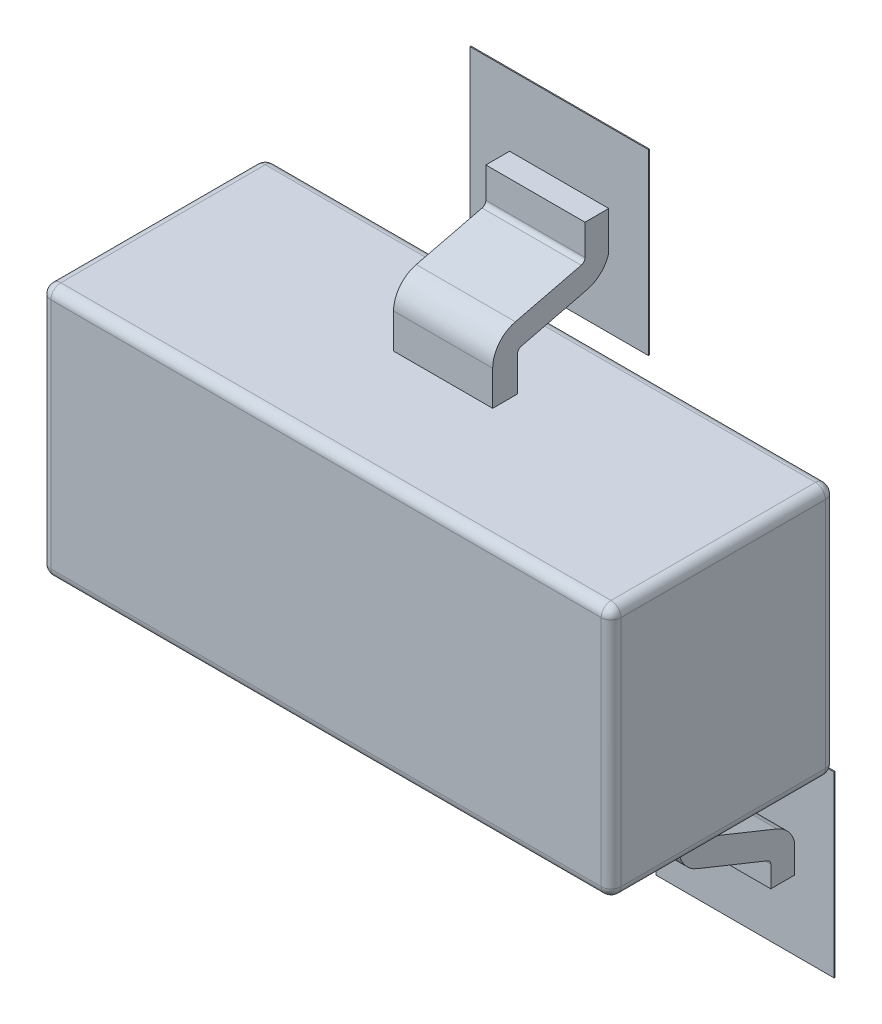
ISO-10303-21;
HEADER;
FILE_DESCRIPTION(('STEP AP214'),'2;1');
FILE_NAME('part.step','',(''),(''),'','','');
FILE_SCHEMA(('AUTOMOTIVE_DESIGN { 1 0 10303 214 1 1 1 1 }'));
ENDSEC;
DATA;
#1=APPLICATION_CONTEXT('core data for automotive mechanical design processes');
#2=APPLICATION_PROTOCOL_DEFINITION('international standard','automotive_design',2000,#1);
#3=PRODUCT_CONTEXT('',#1,'mechanical');
#4=PRODUCT('Part','Part','',(#3));
#5=PRODUCT_RELATED_PRODUCT_CATEGORY('part','',(#4));
#6=PRODUCT_DEFINITION_FORMATION('','',#4);
#7=PRODUCT_DEFINITION_CONTEXT('part definition',#1,'design');
#8=PRODUCT_DEFINITION('design','',#6,#7);
#9=PRODUCT_DEFINITION_SHAPE('','',#8);
#10=(LENGTH_UNIT() NAMED_UNIT(*) SI_UNIT(.MILLI.,.METRE.));
#11=(NAMED_UNIT(*) PLANE_ANGLE_UNIT() SI_UNIT($,.RADIAN.));
#12=(NAMED_UNIT(*) SI_UNIT($,.STERADIAN.) SOLID_ANGLE_UNIT());
#13=UNCERTAINTY_MEASURE_WITH_UNIT(LENGTH_MEASURE(1.E-05),#10,'distance_accuracy_value','');
#14=(GEOMETRIC_REPRESENTATION_CONTEXT(3) GLOBAL_UNCERTAINTY_ASSIGNED_CONTEXT((#13)) GLOBAL_UNIT_ASSIGNED_CONTEXT((#10,
#11,#12)) REPRESENTATION_CONTEXT('',''));
#15=CARTESIAN_POINT('',(0.,0.,0.));
#16=DIRECTION('',(0.,0.,1.));
#17=DIRECTION('',(1.,0.,0.));
#18=AXIS2_PLACEMENT_3D('',#15,#16,#17);
#19=CARTESIAN_POINT('',(1.205992,-1.2450064,0.0762));
#20=DIRECTION('',(0.,0.,-1.));
#21=DIRECTION('',(-1.,0.,0.));
#22=AXIS2_PLACEMENT_3D('',#19,#20,#21);
#23=PLANE('',#22);
#24=DIRECTION('',(1.,0.,0.));
#25=VECTOR('',#24,1.);
#26=CARTESIAN_POINT('',(0.4569968,1.5999968,0.0762));
#27=LINE('',#26,#25);
#28=CARTESIAN_POINT('',(0.4569968,1.5999968,0.0762));
#29=VERTEX_POINT('',#28);
#30=CARTESIAN_POINT('',(-0.4569968,1.5999968,0.0762));
#31=VERTEX_POINT('',#30);
#32=EDGE_CURVE('E717',#29,#31,#27,.F.);
#33=ORIENTED_EDGE('',*,*,#32,.F.);
#34=DIRECTION('',(0.,1.,0.));
#35=VECTOR('',#34,1.);
#36=CARTESIAN_POINT('',(0.4569968,0.6860032,0.0762));
#37=LINE('',#36,#35);
#38=CARTESIAN_POINT('',(0.4569968,0.6860032,0.0762));
#39=VERTEX_POINT('',#38);
#40=EDGE_CURVE('E698',#39,#29,#37,.T.);
#41=ORIENTED_EDGE('',*,*,#40,.F.);
#42=DIRECTION('',(1.,0.,0.));
#43=VECTOR('',#42,1.);
#44=CARTESIAN_POINT('',(-0.4569968,0.6860032,0.0762));
#45=LINE('',#44,#43);
#46=CARTESIAN_POINT('',(-0.4569968,0.6860032,0.0762));
#47=VERTEX_POINT('',#46);
#48=EDGE_CURVE('E707',#47,#39,#45,.T.);
#49=ORIENTED_EDGE('',*,*,#48,.F.);
#50=DIRECTION('',(0.,1.,0.));
#51=VECTOR('',#50,1.);
#52=CARTESIAN_POINT('',(-0.4569968,1.5999968,0.0762));
#53=LINE('',#52,#51);
#54=EDGE_CURVE('E712',#31,#47,#53,.F.);
#55=ORIENTED_EDGE('',*,*,#54,.F.);
#56=EDGE_LOOP('',(#33,#41,#49,#55));
#57=FACE_BOUND('',#56,.T.);
#58=ADVANCED_FACE('F16',(#57),#23,.T.);
#59=CARTESIAN_POINT('',(1.205992,-1.2450064,0.0762));
#60=DIRECTION('',(0.,0.,-1.));
#61=DIRECTION('',(-1.,0.,0.));
#62=AXIS2_PLACEMENT_3D('',#59,#60,#61);
#63=PLANE('',#62);
#64=DIRECTION('',(1.,0.,0.));
#65=VECTOR('',#64,1.);
#66=CARTESIAN_POINT('',(1.4089888,-0.6860032,0.0762));
#67=LINE('',#66,#65);
#68=CARTESIAN_POINT('',(1.4089888,-0.6860032,0.0762));
#69=VERTEX_POINT('',#68);
#70=CARTESIAN_POINT('',(0.4949952,-0.6860032,0.0762));
#71=VERTEX_POINT('',#70);
#72=EDGE_CURVE('E696',#69,#71,#67,.F.);
#73=ORIENTED_EDGE('',*,*,#72,.F.);
#74=DIRECTION('',(0.,1.,0.));
#75=VECTOR('',#74,1.);
#76=CARTESIAN_POINT('',(1.4089888,-1.5999968,0.0762));
#77=LINE('',#76,#75);
#78=CARTESIAN_POINT('',(1.4089888,-1.5999968,0.0762));
#79=VERTEX_POINT('',#78);
#80=EDGE_CURVE('E677',#79,#69,#77,.T.);
#81=ORIENTED_EDGE('',*,*,#80,.F.);
#82=DIRECTION('',(1.,0.,0.));
#83=VECTOR('',#82,1.);
#84=CARTESIAN_POINT('',(0.4949952,-1.5999968,0.0762));
#85=LINE('',#84,#83);
#86=CARTESIAN_POINT('',(0.4949952,-1.5999968,0.0762));
#87=VERTEX_POINT('',#86);
#88=EDGE_CURVE('E686',#87,#79,#85,.T.);
#89=ORIENTED_EDGE('',*,*,#88,.F.);
#90=DIRECTION('',(0.,1.,0.));
#91=VECTOR('',#90,1.);
#92=CARTESIAN_POINT('',(0.4949952,-0.6860032,0.0762));
#93=LINE('',#92,#91);
#94=EDGE_CURVE('E691',#71,#87,#93,.F.);
#95=ORIENTED_EDGE('',*,*,#94,.F.);
#96=EDGE_LOOP('',(#73,#81,#89,#95));
#97=FACE_BOUND('',#96,.T.);
#98=ADVANCED_FACE('F1296',(#97),#63,.T.);
#99=CARTESIAN_POINT('',(1.205992,-1.2450064,0.0762));
#100=DIRECTION('',(0.,0.,-1.));
#101=DIRECTION('',(-1.,0.,0.));
#102=AXIS2_PLACEMENT_3D('',#99,#100,#101);
#103=PLANE('',#102);
#104=DIRECTION('',(1.,0.,0.));
#105=VECTOR('',#104,1.);
#106=CARTESIAN_POINT('',(-0.4949952,-0.6860032,0.0762));
#107=LINE('',#106,#105);
#108=CARTESIAN_POINT('',(-0.4949952,-0.6860032,0.0762));
#109=VERTEX_POINT('',#108);
#110=CARTESIAN_POINT('',(-1.4089888,-0.6860032,0.0762));
#111=VERTEX_POINT('',#110);
#112=EDGE_CURVE('E675',#109,#111,#107,.F.);
#113=ORIENTED_EDGE('',*,*,#112,.F.);
#114=DIRECTION('',(0.,1.,0.));
#115=VECTOR('',#114,1.);
#116=CARTESIAN_POINT('',(-0.4949952,-1.5999968,0.0762));
#117=LINE('',#116,#115);
#118=CARTESIAN_POINT('',(-0.4949952,-1.5999968,0.0762));
#119=VERTEX_POINT('',#118);
#120=EDGE_CURVE('E646',#119,#109,#117,.T.);
#121=ORIENTED_EDGE('',*,*,#120,.F.);
#122=DIRECTION('',(1.,0.,0.));
#123=VECTOR('',#122,1.);
#124=CARTESIAN_POINT('',(-1.4089888,-1.5999968,0.0762));
#125=LINE('',#124,#123);
#126=CARTESIAN_POINT('',(-1.4089888,-1.5999968,0.0762));
#127=VERTEX_POINT('',#126);
#128=EDGE_CURVE('E665',#127,#119,#125,.T.);
#129=ORIENTED_EDGE('',*,*,#128,.F.);
#130=DIRECTION('',(0.,1.,0.));
#131=VECTOR('',#130,1.);
#132=CARTESIAN_POINT('',(-1.4089888,-0.6860032,0.0762));
#133=LINE('',#132,#131);
#134=EDGE_CURVE('E670',#111,#127,#133,.F.);
#135=ORIENTED_EDGE('',*,*,#134,.F.);
#136=EDGE_LOOP('',(#113,#121,#129,#135));
#137=FACE_BOUND('',#136,.T.);
#138=ADVANCED_FACE('F1293',(#137),#103,.T.);
#139=CARTESIAN_POINT('',(0.4569968,1.5999968,0.0762));
#140=DIRECTION('',(0.,1.,0.));
#141=DIRECTION('',(0.,0.,1.));
#142=AXIS2_PLACEMENT_3D('',#139,#140,#141);
#143=PLANE('',#142);
#144=DIRECTION('',(0.,0.,-1.));
#145=VECTOR('',#144,1.);
#146=CARTESIAN_POINT('',(0.4569968,1.5999968,0.0762));
#147=LINE('',#146,#145);
#148=CARTESIAN_POINT('',(0.4569968,1.5999968,0.081534));
#149=VERTEX_POINT('',#148);
#150=EDGE_CURVE('E704',#29,#149,#147,.F.);
#151=ORIENTED_EDGE('',*,*,#150,.F.);
#152=ORIENTED_EDGE('',*,*,#32,.T.);
#153=DIRECTION('',(0.,0.,1.));
#154=VECTOR('',#153,1.);
#155=CARTESIAN_POINT('',(-0.4569968,1.5999968,0.0762));
#156=LINE('',#155,#154);
#157=CARTESIAN_POINT('',(-0.4569968,1.5999968,0.081534));
#158=VERTEX_POINT('',#157);
#159=EDGE_CURVE('E714',#158,#31,#156,.F.);
#160=ORIENTED_EDGE('',*,*,#159,.F.);
#161=DIRECTION('',(1.,0.,0.));
#162=VECTOR('',#161,1.);
#163=CARTESIAN_POINT('',(0.,1.5999968,0.081534));
#164=LINE('',#163,#162);
#165=EDGE_CURVE('E643',#149,#158,#164,.F.);
#166=ORIENTED_EDGE('',*,*,#165,.F.);
#167=EDGE_LOOP('',(#151,#152,#160,#166));
#168=FACE_BOUND('',#167,.T.);
#169=ADVANCED_FACE('F1289',(#168),#143,.T.);
#170=CARTESIAN_POINT('',(-0.4569968,1.5999968,0.0762));
#171=DIRECTION('',(-1.,0.,0.));
#172=DIRECTION('',(0.,0.,1.));
#173=AXIS2_PLACEMENT_3D('',#170,#171,#172);
#174=PLANE('',#173);
#175=ORIENTED_EDGE('',*,*,#159,.T.);
#176=ORIENTED_EDGE('',*,*,#54,.T.);
#177=DIRECTION('',(0.,0.,-1.));
#178=VECTOR('',#177,1.);
#179=CARTESIAN_POINT('',(-0.4569968,0.6860032,0.0762));
#180=LINE('',#179,#178);
#181=CARTESIAN_POINT('',(-0.4569968,0.6860032,0.081534));
#182=VERTEX_POINT('',#181);
#183=EDGE_CURVE('E709',#182,#47,#180,.T.);
#184=ORIENTED_EDGE('',*,*,#183,.F.);
#185=DIRECTION('',(0.,1.,0.));
#186=VECTOR('',#185,1.);
#187=CARTESIAN_POINT('',(-0.4569968,0.,0.081534));
#188=LINE('',#187,#186);
#189=EDGE_CURVE('E640',#158,#182,#188,.F.);
#190=ORIENTED_EDGE('',*,*,#189,.F.);
#191=EDGE_LOOP('',(#175,#176,#184,#190));
#192=FACE_BOUND('',#191,.T.);
#193=ADVANCED_FACE('F1285',(#192),#174,.T.);
#194=CARTESIAN_POINT('',(-0.4569968,0.6860032,0.0762));
#195=DIRECTION('',(0.,-1.,0.));
#196=DIRECTION('',(0.,0.,-1.));
#197=AXIS2_PLACEMENT_3D('',#194,#195,#196);
#198=PLANE('',#197);
#199=ORIENTED_EDGE('',*,*,#183,.T.);
#200=ORIENTED_EDGE('',*,*,#48,.T.);
#201=DIRECTION('',(0.,0.,-1.));
#202=VECTOR('',#201,1.);
#203=CARTESIAN_POINT('',(0.4569968,0.6860032,0.0762));
#204=LINE('',#203,#202);
#205=CARTESIAN_POINT('',(0.4569968,0.6860032,0.081534));
#206=VERTEX_POINT('',#205);
#207=EDGE_CURVE('E701',#206,#39,#204,.T.);
#208=ORIENTED_EDGE('',*,*,#207,.F.);
#209=DIRECTION('',(1.,0.,0.));
#210=VECTOR('',#209,1.);
#211=CARTESIAN_POINT('',(0.,0.6860032,0.081534));
#212=LINE('',#211,#210);
#213=EDGE_CURVE('E637',#182,#206,#212,.T.);
#214=ORIENTED_EDGE('',*,*,#213,.F.);
#215=EDGE_LOOP('',(#199,#200,#208,#214));
#216=FACE_BOUND('',#215,.T.);
#217=ADVANCED_FACE('F1281',(#216),#198,.T.);
#218=CARTESIAN_POINT('',(0.4569968,0.6860032,0.0762));
#219=DIRECTION('',(1.,0.,0.));
#220=DIRECTION('',(0.,0.,-1.));
#221=AXIS2_PLACEMENT_3D('',#218,#219,#220);
#222=PLANE('',#221);
#223=ORIENTED_EDGE('',*,*,#207,.T.);
#224=ORIENTED_EDGE('',*,*,#40,.T.);
#225=ORIENTED_EDGE('',*,*,#150,.T.);
#226=DIRECTION('',(0.,1.,0.));
#227=VECTOR('',#226,1.);
#228=CARTESIAN_POINT('',(0.4569968,0.,0.081534));
#229=LINE('',#228,#227);
#230=EDGE_CURVE('E632',#206,#149,#229,.T.);
#231=ORIENTED_EDGE('',*,*,#230,.F.);
#232=EDGE_LOOP('',(#223,#224,#225,#231));
#233=FACE_BOUND('',#232,.T.);
#234=ADVANCED_FACE('F1277',(#233),#222,.T.);
#235=CARTESIAN_POINT('',(1.4089888,-0.6860032,0.0762));
#236=DIRECTION('',(0.,1.,0.));
#237=DIRECTION('',(0.,0.,1.));
#238=AXIS2_PLACEMENT_3D('',#235,#236,#237);
#239=PLANE('',#238);
#240=DIRECTION('',(0.,0.,-1.));
#241=VECTOR('',#240,1.);
#242=CARTESIAN_POINT('',(1.4089888,-0.6860032,0.0762));
#243=LINE('',#242,#241);
#244=CARTESIAN_POINT('',(1.4089888,-0.6860032,0.081534));
#245=VERTEX_POINT('',#244);
#246=EDGE_CURVE('E683',#69,#245,#243,.F.);
#247=ORIENTED_EDGE('',*,*,#246,.F.);
#248=ORIENTED_EDGE('',*,*,#72,.T.);
#249=DIRECTION('',(0.,0.,1.));
#250=VECTOR('',#249,1.);
#251=CARTESIAN_POINT('',(0.4949952,-0.6860032,0.0762));
#252=LINE('',#251,#250);
#253=CARTESIAN_POINT('',(0.4949952,-0.6860032,0.081534));
#254=VERTEX_POINT('',#253);
#255=EDGE_CURVE('E693',#254,#71,#252,.F.);
#256=ORIENTED_EDGE('',*,*,#255,.F.);
#257=DIRECTION('',(1.,0.,0.));
#258=VECTOR('',#257,1.);
#259=CARTESIAN_POINT('',(0.,-0.6860032,0.081534));
#260=LINE('',#259,#258);
#261=EDGE_CURVE('E1309',#245,#254,#260,.F.);
#262=ORIENTED_EDGE('',*,*,#261,.F.);
#263=EDGE_LOOP('',(#247,#248,#256,#262));
#264=FACE_BOUND('',#263,.T.);
#265=ADVANCED_FACE('F1273',(#264),#239,.T.);
#266=CARTESIAN_POINT('',(0.4949952,-0.6860032,0.0762));
#267=DIRECTION('',(-1.,0.,0.));
#268=DIRECTION('',(0.,0.,1.));
#269=AXIS2_PLACEMENT_3D('',#266,#267,#268);
#270=PLANE('',#269);
#271=ORIENTED_EDGE('',*,*,#255,.T.);
#272=ORIENTED_EDGE('',*,*,#94,.T.);
#273=DIRECTION('',(0.,0.,-1.));
#274=VECTOR('',#273,1.);
#275=CARTESIAN_POINT('',(0.4949952,-1.5999968,0.0762));
#276=LINE('',#275,#274);
#277=CARTESIAN_POINT('',(0.4949952,-1.5999968,0.081534));
#278=VERTEX_POINT('',#277);
#279=EDGE_CURVE('E688',#278,#87,#276,.T.);
#280=ORIENTED_EDGE('',*,*,#279,.F.);
#281=DIRECTION('',(0.,1.,0.));
#282=VECTOR('',#281,1.);
#283=CARTESIAN_POINT('',(0.4949952,0.,0.081534));
#284=LINE('',#283,#282);
#285=EDGE_CURVE('E1318',#254,#278,#284,.F.);
#286=ORIENTED_EDGE('',*,*,#285,.F.);
#287=EDGE_LOOP('',(#271,#272,#280,#286));
#288=FACE_BOUND('',#287,.T.);
#289=ADVANCED_FACE('F1269',(#288),#270,.T.);
#290=CARTESIAN_POINT('',(0.4949952,-1.5999968,0.0762));
#291=DIRECTION('',(0.,-1.,0.));
#292=DIRECTION('',(0.,0.,-1.));
#293=AXIS2_PLACEMENT_3D('',#290,#291,#292);
#294=PLANE('',#293);
#295=ORIENTED_EDGE('',*,*,#279,.T.);
#296=ORIENTED_EDGE('',*,*,#88,.T.);
#297=DIRECTION('',(0.,0.,-1.));
#298=VECTOR('',#297,1.);
#299=CARTESIAN_POINT('',(1.4089888,-1.5999968,0.0762));
#300=LINE('',#299,#298);
#301=CARTESIAN_POINT('',(1.4089888,-1.5999968,0.081534));
#302=VERTEX_POINT('',#301);
#303=EDGE_CURVE('E680',#302,#79,#300,.T.);
#304=ORIENTED_EDGE('',*,*,#303,.F.);
#305=DIRECTION('',(1.,0.,0.));
#306=VECTOR('',#305,1.);
#307=CARTESIAN_POINT('',(0.,-1.5999968,0.081534));
#308=LINE('',#307,#306);
#309=EDGE_CURVE('E1315',#278,#302,#308,.T.);
#310=ORIENTED_EDGE('',*,*,#309,.F.);
#311=EDGE_LOOP('',(#295,#296,#304,#310));
#312=FACE_BOUND('',#311,.T.);
#313=ADVANCED_FACE('F1265',(#312),#294,.T.);
#314=CARTESIAN_POINT('',(1.4089888,-1.5999968,0.0762));
#315=DIRECTION('',(1.,0.,0.));
#316=DIRECTION('',(0.,0.,-1.));
#317=AXIS2_PLACEMENT_3D('',#314,#315,#316);
#318=PLANE('',#317);
#319=ORIENTED_EDGE('',*,*,#303,.T.);
#320=ORIENTED_EDGE('',*,*,#80,.T.);
#321=ORIENTED_EDGE('',*,*,#246,.T.);
#322=DIRECTION('',(0.,1.,0.));
#323=VECTOR('',#322,1.);
#324=CARTESIAN_POINT('',(1.4089888,0.,0.081534));
#325=LINE('',#324,#323);
#326=EDGE_CURVE('E1312',#302,#245,#325,.T.);
#327=ORIENTED_EDGE('',*,*,#326,.F.);
#328=EDGE_LOOP('',(#319,#320,#321,#327));
#329=FACE_BOUND('',#328,.T.);
#330=ADVANCED_FACE('F1261',(#329),#318,.T.);
#331=CARTESIAN_POINT('',(-0.4949952,-0.6860032,0.0762));
#332=DIRECTION('',(0.,1.,0.));
#333=DIRECTION('',(0.,0.,1.));
#334=AXIS2_PLACEMENT_3D('',#331,#332,#333);
#335=PLANE('',#334);
#336=DIRECTION('',(0.,0.,-1.));
#337=VECTOR('',#336,1.);
#338=CARTESIAN_POINT('',(-0.4949952,-0.6860032,0.0762));
#339=LINE('',#338,#337);
#340=CARTESIAN_POINT('',(-0.4949952,-0.6860032,0.081534));
#341=VERTEX_POINT('',#340);
#342=EDGE_CURVE('E662',#109,#341,#339,.F.);
#343=ORIENTED_EDGE('',*,*,#342,.F.);
#344=ORIENTED_EDGE('',*,*,#112,.T.);
#345=DIRECTION('',(0.,0.,1.));
#346=VECTOR('',#345,1.);
#347=CARTESIAN_POINT('',(-1.4089888,-0.6860032,0.0762));
#348=LINE('',#347,#346);
#349=CARTESIAN_POINT('',(-1.4089888,-0.6860032,0.081534));
#350=VERTEX_POINT('',#349);
#351=EDGE_CURVE('E672',#350,#111,#348,.F.);
#352=ORIENTED_EDGE('',*,*,#351,.F.);
#353=DIRECTION('',(1.,0.,0.));
#354=VECTOR('',#353,1.);
#355=CARTESIAN_POINT('',(0.,-0.6860032,0.081534));
#356=LINE('',#355,#354);
#357=EDGE_CURVE('E1331',#341,#350,#356,.F.);
#358=ORIENTED_EDGE('',*,*,#357,.F.);
#359=EDGE_LOOP('',(#343,#344,#352,#358));
#360=FACE_BOUND('',#359,.T.);
#361=ADVANCED_FACE('F1257',(#360),#335,.T.);
#362=CARTESIAN_POINT('',(-1.4089888,-0.6860032,0.0762));
#363=DIRECTION('',(-1.,0.,0.));
#364=DIRECTION('',(0.,0.,1.));
#365=AXIS2_PLACEMENT_3D('',#362,#363,#364);
#366=PLANE('',#365);
#367=ORIENTED_EDGE('',*,*,#351,.T.);
#368=ORIENTED_EDGE('',*,*,#134,.T.);
#369=DIRECTION('',(0.,0.,-1.));
#370=VECTOR('',#369,1.);
#371=CARTESIAN_POINT('',(-1.4089888,-1.5999968,0.0762));
#372=LINE('',#371,#370);
#373=CARTESIAN_POINT('',(-1.4089888,-1.5999968,0.081534));
#374=VERTEX_POINT('',#373);
#375=EDGE_CURVE('E667',#374,#127,#372,.T.);
#376=ORIENTED_EDGE('',*,*,#375,.F.);
#377=DIRECTION('',(0.,1.,0.));
#378=VECTOR('',#377,1.);
#379=CARTESIAN_POINT('',(-1.4089888,0.,0.081534));
#380=LINE('',#379,#378);
#381=EDGE_CURVE('E1431',#350,#374,#380,.F.);
#382=ORIENTED_EDGE('',*,*,#381,.F.);
#383=EDGE_LOOP('',(#367,#368,#376,#382));
#384=FACE_BOUND('',#383,.T.);
#385=ADVANCED_FACE('F1254',(#384),#366,.T.);
#386=CARTESIAN_POINT('',(-1.4089888,-1.5999968,0.0762));
#387=DIRECTION('',(0.,-1.,0.));
#388=DIRECTION('',(0.,0.,-1.));
#389=AXIS2_PLACEMENT_3D('',#386,#387,#388);
#390=PLANE('',#389);
#391=ORIENTED_EDGE('',*,*,#375,.T.);
#392=ORIENTED_EDGE('',*,*,#128,.T.);
#393=DIRECTION('',(0.,0.,-1.));
#394=VECTOR('',#393,1.);
#395=CARTESIAN_POINT('',(-0.4949952,-1.5999968,0.0762));
#396=LINE('',#395,#394);
#397=CARTESIAN_POINT('',(-0.4949952,-1.5999968,0.081534));
#398=VERTEX_POINT('',#397);
#399=EDGE_CURVE('E60',#398,#119,#396,.T.);
#400=ORIENTED_EDGE('',*,*,#399,.F.);
#401=DIRECTION('',(1.,0.,0.));
#402=VECTOR('',#401,1.);
#403=CARTESIAN_POINT('',(0.,-1.5999968,0.081534));
#404=LINE('',#403,#402);
#405=EDGE_CURVE('E1428',#374,#398,#404,.T.);
#406=ORIENTED_EDGE('',*,*,#405,.F.);
#407=EDGE_LOOP('',(#391,#392,#400,#406));
#408=FACE_BOUND('',#407,.T.);
#409=ADVANCED_FACE('F1250',(#408),#390,.T.);
#410=CARTESIAN_POINT('',(-0.4949952,-1.5999968,0.0762));
#411=DIRECTION('',(1.,0.,0.));
#412=DIRECTION('',(0.,0.,-1.));
#413=AXIS2_PLACEMENT_3D('',#410,#411,#412);
#414=PLANE('',#413);
#415=ORIENTED_EDGE('',*,*,#399,.T.);
#416=ORIENTED_EDGE('',*,*,#120,.T.);
#417=ORIENTED_EDGE('',*,*,#342,.T.);
#418=DIRECTION('',(0.,1.,0.));
#419=VECTOR('',#418,1.);
#420=CARTESIAN_POINT('',(-0.4949952,0.,0.081534));
#421=LINE('',#420,#419);
#422=EDGE_CURVE('E1425',#398,#341,#421,.T.);
#423=ORIENTED_EDGE('',*,*,#422,.F.);
#424=EDGE_LOOP('',(#415,#416,#417,#423));
#425=FACE_BOUND('',#424,.T.);
#426=ADVANCED_FACE('F1246',(#425),#414,.T.);
#427=CARTESIAN_POINT('',(0.,0.,0.081534));
#428=DIRECTION('',(0.,0.,1.));
#429=DIRECTION('',(1.,0.,0.));
#430=AXIS2_PLACEMENT_3D('',#427,#428,#429);
#431=PLANE('',#430);
#432=DIRECTION('',(1.,0.,0.));
#433=VECTOR('',#432,1.);
#434=CARTESIAN_POINT('',(-0.254,1.04049747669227,0.0815339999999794));
#435=LINE('',#434,#433);
#436=CARTESIAN_POINT('',(-0.254,1.04049747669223,0.0815339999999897));
#437=VERTEX_POINT('',#436);
#438=CARTESIAN_POINT('',(0.254,1.04049747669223,0.0815339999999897));
#439=VERTEX_POINT('',#438);
#440=EDGE_CURVE('E579',#437,#439,#435,.T.);
#441=ORIENTED_EDGE('',*,*,#440,.F.);
#442=DIRECTION('',(0.,1.,0.));
#443=VECTOR('',#442,1.);
#444=CARTESIAN_POINT('',(-0.254,0.,0.081534));
#445=LINE('',#444,#443);
#446=CARTESIAN_POINT('',(-0.254,1.23720111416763,0.081534));
#447=VERTEX_POINT('',#446);
#448=EDGE_CURVE('E611',#437,#447,#445,.T.);
#449=ORIENTED_EDGE('',*,*,#448,.T.);
#450=DIRECTION('',(1.,0.,0.));
#451=VECTOR('',#450,1.);
#452=CARTESIAN_POINT('',(-0.254,1.23720111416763,0.081534));
#453=LINE('',#452,#451);
#454=CARTESIAN_POINT('',(0.254,1.23720111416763,0.081534));
#455=VERTEX_POINT('',#454);
#456=EDGE_CURVE('E622',#455,#447,#453,.F.);
#457=ORIENTED_EDGE('',*,*,#456,.F.);
#458=DIRECTION('',(0.,1.,0.));
#459=VECTOR('',#458,1.);
#460=CARTESIAN_POINT('',(0.254,0.,0.081534));
#461=LINE('',#460,#459);
#462=EDGE_CURVE('E649',#439,#455,#461,.T.);
#463=ORIENTED_EDGE('',*,*,#462,.F.);
#464=EDGE_LOOP('',(#441,#449,#457,#463));
#465=FACE_BOUND('',#464,.T.);
#466=ORIENTED_EDGE('',*,*,#213,.T.);
#467=ORIENTED_EDGE('',*,*,#230,.T.);
#468=ORIENTED_EDGE('',*,*,#165,.T.);
#469=ORIENTED_EDGE('',*,*,#189,.T.);
#470=EDGE_LOOP('',(#466,#467,#468,#469));
#471=FACE_BOUND('',#470,.T.);
#472=ADVANCED_FACE('F1242',(#465,#471),#431,.T.);
#473=CARTESIAN_POINT('',(-0.254,1.23720111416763,0.0762));
#474=DIRECTION('',(0.,1.,0.));
#475=DIRECTION('',(0.,0.,1.));
#476=AXIS2_PLACEMENT_3D('',#473,#474,#475);
#477=PLANE('',#476);
#478=DIRECTION('',(0.,0.,-1.));
#479=VECTOR('',#478,1.);
#480=CARTESIAN_POINT('',(0.254,1.23720111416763,0.));
#481=LINE('',#480,#479);
#482=CARTESIAN_POINT('',(0.254,1.23720111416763,0.2032));
#483=VERTEX_POINT('',#482);
#484=EDGE_CURVE('E450',#455,#483,#481,.F.);
#485=ORIENTED_EDGE('',*,*,#484,.F.);
#486=ORIENTED_EDGE('',*,*,#456,.T.);
#487=DIRECTION('',(0.,0.,-1.));
#488=VECTOR('',#487,1.);
#489=CARTESIAN_POINT('',(-0.254,1.23720111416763,0.));
#490=LINE('',#489,#488);
#491=CARTESIAN_POINT('',(-0.254,1.23720111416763,0.2032));
#492=VERTEX_POINT('',#491);
#493=EDGE_CURVE('E625',#447,#492,#490,.F.);
#494=ORIENTED_EDGE('',*,*,#493,.T.);
#495=DIRECTION('',(1.,0.,0.));
#496=VECTOR('',#495,1.);
#497=CARTESIAN_POINT('',(-0.254,1.23720111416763,0.2032));
#498=LINE('',#497,#496);
#499=EDGE_CURVE('E619',#483,#492,#498,.F.);
#500=ORIENTED_EDGE('',*,*,#499,.F.);
#501=EDGE_LOOP('',(#485,#486,#494,#500));
#502=FACE_BOUND('',#501,.T.);
#503=ADVANCED_FACE('F1239',(#502),#477,.T.);
#504=CARTESIAN_POINT('',(-0.254,1.23720111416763,0.2032));
#505=DIRECTION('',(0.,0.,1.));
#506=DIRECTION('',(1.,0.,0.));
#507=AXIS2_PLACEMENT_3D('',#504,#505,#506);
#508=PLANE('',#507);
#509=ORIENTED_EDGE('',*,*,#499,.T.);
#510=DIRECTION('',(0.,1.,0.));
#511=VECTOR('',#510,1.);
#512=CARTESIAN_POINT('',(-0.254,0.,0.2032));
#513=LINE('',#512,#511);
#514=CARTESIAN_POINT('',(-0.254,1.08046435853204,0.2032));
#515=VERTEX_POINT('',#514);
#516=EDGE_CURVE('E627',#492,#515,#513,.F.);
#517=ORIENTED_EDGE('',*,*,#516,.T.);
#518=DIRECTION('',(1.,0.,0.));
#519=VECTOR('',#518,1.);
#520=CARTESIAN_POINT('',(-0.254,1.08046435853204,0.2032));
#521=LINE('',#520,#519);
#522=CARTESIAN_POINT('',(0.254,1.08046435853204,0.2032));
#523=VERTEX_POINT('',#522);
#524=EDGE_CURVE('E420',#515,#523,#521,.T.);
#525=ORIENTED_EDGE('',*,*,#524,.T.);
#526=DIRECTION('',(0.,1.,0.));
#527=VECTOR('',#526,1.);
#528=CARTESIAN_POINT('',(0.254,0.,0.2032));
#529=LINE('',#528,#527);
#530=EDGE_CURVE('E448',#483,#523,#529,.F.);
#531=ORIENTED_EDGE('',*,*,#530,.F.);
#532=EDGE_LOOP('',(#509,#517,#525,#531));
#533=FACE_BOUND('',#532,.T.);
#534=ADVANCED_FACE('F1236',(#533),#508,.T.);
#535=CARTESIAN_POINT('',(-0.254,1.08046435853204,0.2286));
#536=DIRECTION('',(1.,0.,0.));
#537=DIRECTION('',(0.,0.,-1.));
#538=AXIS2_PLACEMENT_3D('',#535,#536,#537);
#539=CYLINDRICAL_SURFACE('',#538,0.0254);
#540=CARTESIAN_POINT('',(0.254,1.08046435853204,0.2286));
#541=DIRECTION('',(1.,0.,0.));
#542=DIRECTION('',(0.,0.,-1.));
#543=AXIS2_PLACEMENT_3D('',#540,#541,#542);
#544=CIRCLE('',#543,0.0254);
#545=CARTESIAN_POINT('',(0.254,1.05578715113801,0.222583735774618));
#546=VERTEX_POINT('',#545);
#547=EDGE_CURVE('E429',#523,#546,#544,.F.);
#548=ORIENTED_EDGE('',*,*,#547,.F.);
#549=ORIENTED_EDGE('',*,*,#524,.F.);
#550=CARTESIAN_POINT('',(-0.254,1.08046435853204,0.2286));
#551=DIRECTION('',(1.,0.,0.));
#552=DIRECTION('',(0.,0.,-1.));
#553=AXIS2_PLACEMENT_3D('',#550,#551,#552);
#554=CIRCLE('',#553,0.0254);
#555=CARTESIAN_POINT('',(-0.254,1.05578715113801,0.222583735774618));
#556=VERTEX_POINT('',#555);
#557=EDGE_CURVE('E432',#515,#556,#554,.F.);
#558=ORIENTED_EDGE('',*,*,#557,.T.);
#559=DIRECTION('',(1.,0.,0.));
#560=VECTOR('',#559,1.);
#561=CARTESIAN_POINT('',(-0.254,1.05578715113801,0.222583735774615));
#562=LINE('',#561,#560);
#563=EDGE_CURVE('E425',#546,#556,#562,.F.);
#564=ORIENTED_EDGE('',*,*,#563,.F.);
#565=EDGE_LOOP('',(#548,#549,#558,#564));
#566=FACE_BOUND('',#565,.T.);
#567=ADVANCED_FACE('F427',(#566),#539,.F.);
#568=CARTESIAN_POINT('',(-0.254,1.05578715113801,0.222583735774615));
#569=DIRECTION('',(0.,0.971543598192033,0.236860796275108));
#570=DIRECTION('',(0.,-0.236860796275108,0.971543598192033));
#571=AXIS2_PLACEMENT_3D('',#568,#569,#570);
#572=PLANE('',#571);
#573=ORIENTED_EDGE('',*,*,#563,.T.);
#574=DIRECTION('',(0.,-0.236860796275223,0.971543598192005));
#575=VECTOR('',#574,1.);
#576=CARTESIAN_POINT('',(-0.254,1.05578715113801,0.222583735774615));
#577=LINE('',#576,#575);
#578=CARTESIAN_POINT('',(-0.254,0.973563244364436,0.559845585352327));
#579=VERTEX_POINT('',#578);
#580=EDGE_CURVE('E870',#556,#579,#577,.T.);
#581=ORIENTED_EDGE('',*,*,#580,.T.);
#582=DIRECTION('',(1.,0.,0.));
#583=VECTOR('',#582,1.);
#584=CARTESIAN_POINT('',(-0.254,0.973563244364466,0.559845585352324));
#585=LINE('',#584,#583);
#586=CARTESIAN_POINT('',(0.254,0.973563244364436,0.559845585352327));
#587=VERTEX_POINT('',#586);
#588=EDGE_CURVE('E435',#587,#579,#585,.F.);
#589=ORIENTED_EDGE('',*,*,#588,.F.);
#590=DIRECTION('',(0.,-0.236860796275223,0.971543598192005));
#591=VECTOR('',#590,1.);
#592=CARTESIAN_POINT('',(0.254,1.05578715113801,0.222583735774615));
#593=LINE('',#592,#591);
#594=EDGE_CURVE('E438',#546,#587,#593,.T.);
#595=ORIENTED_EDGE('',*,*,#594,.F.);
#596=EDGE_LOOP('',(#573,#581,#589,#595));
#597=FACE_BOUND('',#596,.T.);
#598=ADVANCED_FACE('F439',(#597),#572,.T.);
#599=CARTESIAN_POINT('',(-0.254,0.8255,0.523748));
#600=DIRECTION('',(1.,0.,0.));
#601=DIRECTION('',(0.,0.,-1.));
#602=AXIS2_PLACEMENT_3D('',#599,#600,#601);
#603=CYLINDRICAL_SURFACE('',#602,0.1524);
#604=ORIENTED_EDGE('',*,*,#588,.T.);
#605=CARTESIAN_POINT('',(-0.254,0.8255,0.523748));
#606=DIRECTION('',(1.,0.,0.));
#607=DIRECTION('',(0.,0.,-1.));
#608=AXIS2_PLACEMENT_3D('',#605,#606,#607);
#609=CIRCLE('',#608,0.1524);
#610=CARTESIAN_POINT('',(-0.254,0.8255,0.676148));
#611=VERTEX_POINT('',#610);
#612=EDGE_CURVE('E867',#579,#611,#609,.T.);
#613=ORIENTED_EDGE('',*,*,#612,.T.);
#614=DIRECTION('',(1.,0.,0.));
#615=VECTOR('',#614,1.);
#616=CARTESIAN_POINT('',(-0.254,0.8255,0.676148));
#617=LINE('',#616,#615);
#618=CARTESIAN_POINT('',(0.254,0.8255,0.676148));
#619=VERTEX_POINT('',#618);
#620=EDGE_CURVE('E608',#619,#611,#617,.F.);
#621=ORIENTED_EDGE('',*,*,#620,.F.);
#622=CARTESIAN_POINT('',(0.254,0.8255,0.523748));
#623=DIRECTION('',(1.,0.,0.));
#624=DIRECTION('',(0.,0.,-1.));
#625=AXIS2_PLACEMENT_3D('',#622,#623,#624);
#626=CIRCLE('',#625,0.1524);
#627=EDGE_CURVE('E443',#587,#619,#626,.T.);
#628=ORIENTED_EDGE('',*,*,#627,.F.);
#629=EDGE_LOOP('',(#604,#613,#621,#628));
#630=FACE_BOUND('',#629,.T.);
#631=ADVANCED_FACE('F1227',(#630),#603,.T.);
#632=CARTESIAN_POINT('',(-0.254,0.8255,0.523748));
#633=DIRECTION('',(1.,0.,0.));
#634=DIRECTION('',(0.,0.,-1.));
#635=AXIS2_PLACEMENT_3D('',#632,#633,#634);
#636=CYLINDRICAL_SURFACE('',#635,0.0254);
#637=CARTESIAN_POINT('',(0.254,0.8255,0.523748));
#638=DIRECTION('',(1.,0.,0.));
#639=DIRECTION('',(0.,0.,-1.));
#640=AXIS2_PLACEMENT_3D('',#637,#638,#639);
#641=CIRCLE('',#640,0.0254);
#642=CARTESIAN_POINT('',(0.254,0.8255,0.549148));
#643=VERTEX_POINT('',#642);
#644=CARTESIAN_POINT('',(0.254,0.850177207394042,0.529764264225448));
#645=VERTEX_POINT('',#644);
#646=EDGE_CURVE('E874',#643,#645,#641,.F.);
#647=ORIENTED_EDGE('',*,*,#646,.F.);
#648=DIRECTION('',(-1.,0.,0.));
#649=VECTOR('',#648,1.);
#650=CARTESIAN_POINT('',(-0.254,0.8255,0.549148));
#651=LINE('',#650,#649);
#652=CARTESIAN_POINT('',(-0.254,0.8255,0.549148));
#653=VERTEX_POINT('',#652);
#654=EDGE_CURVE('E458',#653,#643,#651,.F.);
#655=ORIENTED_EDGE('',*,*,#654,.F.);
#656=CARTESIAN_POINT('',(-0.254,0.8255,0.523748));
#657=DIRECTION('',(1.,0.,0.));
#658=DIRECTION('',(0.,0.,-1.));
#659=AXIS2_PLACEMENT_3D('',#656,#657,#658);
#660=CIRCLE('',#659,0.0254);
#661=CARTESIAN_POINT('',(-0.254,0.850177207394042,0.529764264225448));
#662=VERTEX_POINT('',#661);
#663=EDGE_CURVE('E864',#653,#662,#660,.F.);
#664=ORIENTED_EDGE('',*,*,#663,.T.);
#665=DIRECTION('',(1.,0.,0.));
#666=VECTOR('',#665,1.);
#667=CARTESIAN_POINT('',(-0.254,0.850177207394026,0.529764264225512));
#668=LINE('',#667,#666);
#669=EDGE_CURVE('E589',#645,#662,#668,.F.);
#670=ORIENTED_EDGE('',*,*,#669,.F.);
#671=EDGE_LOOP('',(#647,#655,#664,#670));
#672=FACE_BOUND('',#671,.T.);
#673=ADVANCED_FACE('F1221',(#672),#636,.F.);
#674=CARTESIAN_POINT('',(-0.254,0.850177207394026,0.529764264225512));
#675=DIRECTION('',(0.,-0.971543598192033,-0.236860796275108));
#676=DIRECTION('',(0.,0.236860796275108,-0.971543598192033));
#677=AXIS2_PLACEMENT_3D('',#674,#675,#676);
#678=PLANE('',#677);
#679=ORIENTED_EDGE('',*,*,#669,.T.);
#680=DIRECTION('',(0.,0.236860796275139,-0.971543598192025));
#681=VECTOR('',#680,1.);
#682=CARTESIAN_POINT('',(-0.254,0.850177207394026,0.529764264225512));
#683=LINE('',#682,#681);
#684=CARTESIAN_POINT('',(-0.254,0.932401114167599,0.192502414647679));
#685=VERTEX_POINT('',#684);
#686=EDGE_CURVE('E863',#662,#685,#683,.T.);
#687=ORIENTED_EDGE('',*,*,#686,.T.);
#688=DIRECTION('',(1.,0.,0.));
#689=VECTOR('',#688,1.);
#690=CARTESIAN_POINT('',(-0.254,0.932401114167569,0.192502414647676));
#691=LINE('',#690,#689);
#692=CARTESIAN_POINT('',(0.254,0.932401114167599,0.192502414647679));
#693=VERTEX_POINT('',#692);
#694=EDGE_CURVE('E586',#693,#685,#691,.F.);
#695=ORIENTED_EDGE('',*,*,#694,.F.);
#696=DIRECTION('',(0.,0.236860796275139,-0.971543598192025));
#697=VECTOR('',#696,1.);
#698=CARTESIAN_POINT('',(0.254,0.850177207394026,0.529764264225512));
#699=LINE('',#698,#697);
#700=EDGE_CURVE('E873',#645,#693,#699,.T.);
#701=ORIENTED_EDGE('',*,*,#700,.F.);
#702=EDGE_LOOP('',(#679,#687,#695,#701));
#703=FACE_BOUND('',#702,.T.);
#704=ADVANCED_FACE('F1216',(#703),#678,.T.);
#705=CARTESIAN_POINT('',(-0.254,1.08046435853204,0.2286));
#706=DIRECTION('',(1.,0.,0.));
#707=DIRECTION('',(0.,0.,-1.));
#708=AXIS2_PLACEMENT_3D('',#705,#706,#707);
#709=CYLINDRICAL_SURFACE('',#708,0.1524);
#710=CARTESIAN_POINT('',(-0.254,1.08046435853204,0.2286));
#711=DIRECTION('',(1.,0.,0.));
#712=DIRECTION('',(0.,0.,-1.));
#713=AXIS2_PLACEMENT_3D('',#710,#711,#712);
#714=CIRCLE('',#713,0.1524);
#715=EDGE_CURVE('E860',#685,#437,#714,.T.);
#716=ORIENTED_EDGE('',*,*,#715,.T.);
#717=ORIENTED_EDGE('',*,*,#440,.T.);
#718=CARTESIAN_POINT('',(0.254,1.08046435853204,0.2286));
#719=DIRECTION('',(1.,0.,0.));
#720=DIRECTION('',(0.,0.,-1.));
#721=AXIS2_PLACEMENT_3D('',#718,#719,#720);
#722=CIRCLE('',#721,0.1524);
#723=EDGE_CURVE('E872',#693,#439,#722,.T.);
#724=ORIENTED_EDGE('',*,*,#723,.F.);
#725=ORIENTED_EDGE('',*,*,#694,.T.);
#726=EDGE_LOOP('',(#716,#717,#724,#725));
#727=FACE_BOUND('',#726,.T.);
#728=ADVANCED_FACE('F1212',(#727),#709,.T.);
#729=CARTESIAN_POINT('',(-1.4097,0.5969,0.1778));
#730=DIRECTION('',(-0.707106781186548,0.,-0.707106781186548));
#731=DIRECTION('',(0.,1.,0.));
#732=AXIS2_PLACEMENT_3D('',#729,#730,#731);
#733=SPHERICAL_SURFACE('',#732,0.0508);
#734=CARTESIAN_POINT('',(-1.4097,0.5969,0.1778));
#735=DIRECTION('',(0.,-1.,0.));
#736=DIRECTION('',(0.,0.,-1.));
#737=AXIS2_PLACEMENT_3D('',#734,#735,#736);
#738=CIRCLE('',#737,0.0508);
#739=CARTESIAN_POINT('',(-1.4605,0.5969,0.1778));
#740=VERTEX_POINT('',#739);
#741=CARTESIAN_POINT('',(-1.44562102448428,0.5969,0.141878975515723));
#742=VERTEX_POINT('',#741);
#743=EDGE_CURVE('E856',#740,#742,#738,.T.);
#744=ORIENTED_EDGE('',*,*,#743,.F.);
#745=CARTESIAN_POINT('',(-1.4097,0.5969,0.1778));
#746=DIRECTION('',(0.,0.,-1.));
#747=DIRECTION('',(-1.,0.,0.));
#748=AXIS2_PLACEMENT_3D('',#745,#746,#747);
#749=CIRCLE('',#748,0.0508);
#750=CARTESIAN_POINT('',(-1.4097,0.6477,0.1778));
#751=VERTEX_POINT('',#750);
#752=EDGE_CURVE('E857',#751,#740,#749,.F.);
#753=ORIENTED_EDGE('',*,*,#752,.F.);
#754=CARTESIAN_POINT('',(-1.4097,0.5969,0.1778));
#755=DIRECTION('',(-1.,0.,0.));
#756=DIRECTION('',(0.,0.,1.));
#757=AXIS2_PLACEMENT_3D('',#754,#755,#756);
#758=CIRCLE('',#757,0.0508);
#759=CARTESIAN_POINT('',(-1.4097,0.5969,0.127));
#760=VERTEX_POINT('',#759);
#761=EDGE_CURVE('E19',#760,#751,#758,.F.);
#762=ORIENTED_EDGE('',*,*,#761,.F.);
#763=CARTESIAN_POINT('',(-1.4097,0.5969,0.1778));
#764=DIRECTION('',(0.,-1.,0.));
#765=DIRECTION('',(0.,0.,-1.));
#766=AXIS2_PLACEMENT_3D('',#763,#764,#765);
#767=CIRCLE('',#766,0.0508);
#768=EDGE_CURVE('E583',#742,#760,#767,.T.);
#769=ORIENTED_EDGE('',*,*,#768,.F.);
#770=EDGE_LOOP('',(#744,#753,#762,#769));
#771=FACE_BOUND('',#770,.T.);
#772=ADVANCED_FACE('F562',(#771),#733,.T.);
#773=CARTESIAN_POINT('',(-1.4097,-0.5969,0.1778));
#774=DIRECTION('',(0.,-0.707106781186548,-0.707106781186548));
#775=DIRECTION('',(-1.,0.,0.));
#776=AXIS2_PLACEMENT_3D('',#773,#774,#775);
#777=SPHERICAL_SURFACE('',#776,0.0508);
#778=CARTESIAN_POINT('',(-1.4097,-0.5969,0.1778));
#779=DIRECTION('',(1.,0.,0.));
#780=DIRECTION('',(0.,0.,-1.));
#781=AXIS2_PLACEMENT_3D('',#778,#779,#780);
#782=CIRCLE('',#781,0.0508);
#783=CARTESIAN_POINT('',(-1.4097,-0.632821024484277,0.141878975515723));
#784=VERTEX_POINT('',#783);
#785=CARTESIAN_POINT('',(-1.4097,-0.5969,0.127));
#786=VERTEX_POINT('',#785);
#787=EDGE_CURVE('E575',#784,#786,#782,.T.);
#788=ORIENTED_EDGE('',*,*,#787,.F.);
#789=CARTESIAN_POINT('',(-1.4097,-0.5969,0.1778));
#790=DIRECTION('',(1.,0.,0.));
#791=DIRECTION('',(0.,0.,-1.));
#792=AXIS2_PLACEMENT_3D('',#789,#790,#791);
#793=CIRCLE('',#792,0.0508);
#794=CARTESIAN_POINT('',(-1.4097,-0.6477,0.1778));
#795=VERTEX_POINT('',#794);
#796=EDGE_CURVE('E846',#795,#784,#793,.T.);
#797=ORIENTED_EDGE('',*,*,#796,.F.);
#798=CARTESIAN_POINT('',(-1.4097,-0.5969,0.1778));
#799=DIRECTION('',(0.,0.,-1.));
#800=DIRECTION('',(-1.,0.,0.));
#801=AXIS2_PLACEMENT_3D('',#798,#799,#800);
#802=CIRCLE('',#801,0.0508);
#803=CARTESIAN_POINT('',(-1.4605,-0.5969,0.1778));
#804=VERTEX_POINT('',#803);
#805=EDGE_CURVE('E850',#804,#795,#802,.F.);
#806=ORIENTED_EDGE('',*,*,#805,.F.);
#807=CARTESIAN_POINT('',(-1.4097,-0.5969,0.1778));
#808=DIRECTION('',(0.,-1.,0.));
#809=DIRECTION('',(0.,0.,-1.));
#810=AXIS2_PLACEMENT_3D('',#807,#808,#809);
#811=CIRCLE('',#810,0.0508);
#812=EDGE_CURVE('E582',#786,#804,#811,.F.);
#813=ORIENTED_EDGE('',*,*,#812,.F.);
#814=EDGE_LOOP('',(#788,#797,#806,#813));
#815=FACE_BOUND('',#814,.T.);
#816=ADVANCED_FACE('F557',(#815),#777,.T.);
#817=CARTESIAN_POINT('',(0.,0.,0.127));
#818=DIRECTION('',(0.,0.,1.));
#819=DIRECTION('',(1.,0.,0.));
#820=AXIS2_PLACEMENT_3D('',#817,#818,#819);
#821=PLANE('',#820);
#822=DIRECTION('',(0.,1.,0.));
#823=VECTOR('',#822,1.);
#824=CARTESIAN_POINT('',(1.4097,0.,0.127));
#825=LINE('',#824,#823);
#826=CARTESIAN_POINT('',(1.4097,-0.5969,0.127));
#827=VERTEX_POINT('',#826);
#828=CARTESIAN_POINT('',(1.4097,0.5969,0.127));
#829=VERTEX_POINT('',#828);
#830=EDGE_CURVE('E576',#827,#829,#825,.T.);
#831=ORIENTED_EDGE('',*,*,#830,.F.);
#832=DIRECTION('',(1.,0.,0.));
#833=VECTOR('',#832,1.);
#834=CARTESIAN_POINT('',(-5.4973728,-0.5969,0.127));
#835=LINE('',#834,#833);
#836=EDGE_CURVE('E571',#786,#827,#835,.T.);
#837=ORIENTED_EDGE('',*,*,#836,.F.);
#838=DIRECTION('',(0.,-1.,0.));
#839=VECTOR('',#838,1.);
#840=CARTESIAN_POINT('',(-1.4097,5.77150845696,0.127));
#841=LINE('',#840,#839);
#842=EDGE_CURVE('E580',#760,#786,#841,.T.);
#843=ORIENTED_EDGE('',*,*,#842,.F.);
#844=DIRECTION('',(-1.,0.,0.));
#845=VECTOR('',#844,1.);
#846=CARTESIAN_POINT('',(5.4973728,0.5969,0.127));
#847=LINE('',#846,#845);
#848=EDGE_CURVE('E454',#829,#760,#847,.T.);
#849=ORIENTED_EDGE('',*,*,#848,.F.);
#850=EDGE_LOOP('',(#831,#837,#843,#849));
#851=FACE_BOUND('',#850,.T.);
#852=ADVANCED_FACE('F553',(#851),#821,.F.);
#853=CARTESIAN_POINT('',(1.205992,-1.13616600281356,0.2286));
#854=DIRECTION('',(1.,0.,0.));
#855=DIRECTION('',(0.,0.,-1.));
#856=AXIS2_PLACEMENT_3D('',#853,#854,#855);
#857=CYLINDRICAL_SURFACE('',#856,0.1524);
#858=CARTESIAN_POINT('',(1.205992,-1.13616600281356,0.2286));
#859=DIRECTION('',(1.,0.,0.));
#860=DIRECTION('',(0.,0.,-1.));
#861=AXIS2_PLACEMENT_3D('',#858,#859,#860);
#862=CIRCLE('',#861,0.1524);
#863=CARTESIAN_POINT('',(1.205992,-1.09619912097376,0.081534));
#864=VERTEX_POINT('',#863);
#865=CARTESIAN_POINT('',(1.205992,-0.9948164,0.171625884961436));
#866=VERTEX_POINT('',#865);
#867=EDGE_CURVE('E827',#864,#866,#862,.T.);
#868=ORIENTED_EDGE('',*,*,#867,.F.);
#869=DIRECTION('',(1.,0.,0.));
#870=VECTOR('',#869,1.);
#871=CARTESIAN_POINT('',(0.,-1.0961991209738,0.081534));
#872=LINE('',#871,#870);
#873=CARTESIAN_POINT('',(0.697992,-1.09619912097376,0.081534));
#874=VERTEX_POINT('',#873);
#875=EDGE_CURVE('E1328',#874,#864,#872,.T.);
#876=ORIENTED_EDGE('',*,*,#875,.F.);
#877=CARTESIAN_POINT('',(0.697992,-1.13616600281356,0.2286));
#878=DIRECTION('',(1.,0.,0.));
#879=DIRECTION('',(0.,0.,-1.));
#880=AXIS2_PLACEMENT_3D('',#877,#878,#879);
#881=CIRCLE('',#880,0.1524);
#882=CARTESIAN_POINT('',(0.697992,-0.9948164,0.171625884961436));
#883=VERTEX_POINT('',#882);
#884=EDGE_CURVE('E841',#874,#883,#881,.T.);
#885=ORIENTED_EDGE('',*,*,#884,.T.);
#886=DIRECTION('',(1.,0.,0.));
#887=VECTOR('',#886,1.);
#888=CARTESIAN_POINT('',(1.205992,-0.9948164,0.171625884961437));
#889=LINE('',#888,#887);
#890=EDGE_CURVE('E578',#866,#883,#889,.F.);
#891=ORIENTED_EDGE('',*,*,#890,.F.);
#892=EDGE_LOOP('',(#868,#876,#885,#891));
#893=FACE_BOUND('',#892,.T.);
#894=ADVANCED_FACE('F549',(#893),#857,.T.);
#895=CARTESIAN_POINT('',(1.205992,-0.9948164,0.171625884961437));
#896=DIRECTION('',(0.,0.92749083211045,-0.37384589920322));
#897=DIRECTION('',(0.,0.37384589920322,0.92749083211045));
#898=AXIS2_PLACEMENT_3D('',#895,#896,#897);
#899=PLANE('',#898);
#900=DIRECTION('',(1.,0.,0.));
#901=VECTOR('',#900,1.);
#902=CARTESIAN_POINT('',(1.205992,-0.849058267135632,0.533243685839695));
#903=LINE('',#902,#901);
#904=CARTESIAN_POINT('',(0.697992,-0.849058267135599,0.533243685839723));
#905=VERTEX_POINT('',#904);
#906=CARTESIAN_POINT('',(1.205992,-0.849058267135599,0.533243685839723));
#907=VERTEX_POINT('',#906);
#908=EDGE_CURVE('E1349',#905,#907,#903,.T.);
#909=ORIENTED_EDGE('',*,*,#908,.T.);
#910=DIRECTION('',(0.,0.373845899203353,0.927490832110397));
#911=VECTOR('',#910,1.);
#912=CARTESIAN_POINT('',(1.205992,-0.9948164,0.171625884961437));
#913=LINE('',#912,#911);
#914=EDGE_CURVE('E826',#866,#907,#913,.T.);
#915=ORIENTED_EDGE('',*,*,#914,.F.);
#916=ORIENTED_EDGE('',*,*,#890,.T.);
#917=DIRECTION('',(0.,0.373845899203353,0.927490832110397));
#918=VECTOR('',#917,1.);
#919=CARTESIAN_POINT('',(0.697992,-0.9948164,0.171625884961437));
#920=LINE('',#919,#918);
#921=EDGE_CURVE('E840',#883,#905,#920,.T.);
#922=ORIENTED_EDGE('',*,*,#921,.T.);
#923=EDGE_LOOP('',(#909,#915,#916,#922));
#924=FACE_BOUND('',#923,.T.);
#925=ADVANCED_FACE('F545',(#924),#899,.T.);
#926=CARTESIAN_POINT('',(1.205992,-0.8255,0.523748));
#927=DIRECTION('',(1.,0.,0.));
#928=DIRECTION('',(0.,0.,-1.));
#929=AXIS2_PLACEMENT_3D('',#926,#927,#928);
#930=CYLINDRICAL_SURFACE('',#929,0.0254);
#931=CARTESIAN_POINT('',(0.697992,-0.8255,0.523748));
#932=DIRECTION('',(1.,0.,0.));
#933=DIRECTION('',(0.,0.,-1.));
#934=AXIS2_PLACEMENT_3D('',#931,#932,#933);
#935=CIRCLE('',#934,0.0254);
#936=CARTESIAN_POINT('',(0.697992,-0.8255,0.549148));
#937=VERTEX_POINT('',#936);
#938=EDGE_CURVE('E838',#905,#937,#935,.F.);
#939=ORIENTED_EDGE('',*,*,#938,.T.);
#940=DIRECTION('',(-1.,0.,0.));
#941=VECTOR('',#940,1.);
#942=CARTESIAN_POINT('',(1.205992,-0.8255,0.549148));
#943=LINE('',#942,#941);
#944=CARTESIAN_POINT('',(1.205992,-0.8255,0.549148));
#945=VERTEX_POINT('',#944);
#946=EDGE_CURVE('E574',#945,#937,#943,.T.);
#947=ORIENTED_EDGE('',*,*,#946,.F.);
#948=CARTESIAN_POINT('',(1.205992,-0.8255,0.523748));
#949=DIRECTION('',(1.,0.,0.));
#950=DIRECTION('',(0.,0.,-1.));
#951=AXIS2_PLACEMENT_3D('',#948,#949,#950);
#952=CIRCLE('',#951,0.0254);
#953=EDGE_CURVE('E822',#907,#945,#952,.F.);
#954=ORIENTED_EDGE('',*,*,#953,.F.);
#955=ORIENTED_EDGE('',*,*,#908,.F.);
#956=EDGE_LOOP('',(#939,#947,#954,#955));
#957=FACE_BOUND('',#956,.T.);
#958=ADVANCED_FACE('F541',(#957),#930,.F.);
#959=CARTESIAN_POINT('',(1.205992,-0.8255,0.523748));
#960=DIRECTION('',(1.,0.,0.));
#961=DIRECTION('',(0.,0.,-1.));
#962=AXIS2_PLACEMENT_3D('',#959,#960,#961);
#963=CYLINDRICAL_SURFACE('',#962,0.1524);
#964=DIRECTION('',(1.,0.,0.));
#965=VECTOR('',#964,1.);
#966=CARTESIAN_POINT('',(1.205992,-0.966849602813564,0.580722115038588));
#967=LINE('',#966,#965);
#968=CARTESIAN_POINT('',(1.205992,-0.96684960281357,0.580722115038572));
#969=VERTEX_POINT('',#968);
#970=CARTESIAN_POINT('',(0.697992,-0.96684960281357,0.580722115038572));
#971=VERTEX_POINT('',#970);
#972=EDGE_CURVE('E1346',#969,#971,#967,.F.);
#973=ORIENTED_EDGE('',*,*,#972,.F.);
#974=CARTESIAN_POINT('',(1.205992,-0.8255,0.523748));
#975=DIRECTION('',(1.,0.,0.));
#976=DIRECTION('',(0.,0.,-1.));
#977=AXIS2_PLACEMENT_3D('',#974,#975,#976);
#978=CIRCLE('',#977,0.1524);
#979=CARTESIAN_POINT('',(1.205992,-0.8255,0.676148));
#980=VERTEX_POINT('',#979);
#981=EDGE_CURVE('E818',#980,#969,#978,.T.);
#982=ORIENTED_EDGE('',*,*,#981,.F.);
#983=DIRECTION('',(1.,0.,0.));
#984=VECTOR('',#983,1.);
#985=CARTESIAN_POINT('',(1.205992,-0.8255,0.676148));
#986=LINE('',#985,#984);
#987=CARTESIAN_POINT('',(0.697992,-0.8255,0.676148));
#988=VERTEX_POINT('',#987);
#989=EDGE_CURVE('E830',#988,#980,#986,.T.);
#990=ORIENTED_EDGE('',*,*,#989,.F.);
#991=CARTESIAN_POINT('',(0.697992,-0.8255,0.523748));
#992=DIRECTION('',(1.,0.,0.));
#993=DIRECTION('',(0.,0.,-1.));
#994=AXIS2_PLACEMENT_3D('',#991,#992,#993);
#995=CIRCLE('',#994,0.1524);
#996=EDGE_CURVE('E835',#988,#971,#995,.T.);
#997=ORIENTED_EDGE('',*,*,#996,.T.);
#998=EDGE_LOOP('',(#973,#982,#990,#997));
#999=FACE_BOUND('',#998,.T.);
#1000=ADVANCED_FACE('F537',(#999),#963,.T.);
#1001=CARTESIAN_POINT('',(1.205992,-0.966849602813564,0.580722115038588));
#1002=DIRECTION('',(0.,-0.92749083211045,0.37384589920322));
#1003=DIRECTION('',(0.,-0.37384589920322,-0.92749083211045));
#1004=AXIS2_PLACEMENT_3D('',#1001,#1002,#1003);
#1005=PLANE('',#1004);
#1006=DIRECTION('',(1.,0.,0.));
#1007=VECTOR('',#1006,1.);
#1008=CARTESIAN_POINT('',(1.205992,-1.11260773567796,0.219104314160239));
#1009=LINE('',#1008,#1007);
#1010=CARTESIAN_POINT('',(0.697992,-1.11260773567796,0.21910431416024));
#1011=VERTEX_POINT('',#1010);
#1012=CARTESIAN_POINT('',(1.205992,-1.11260773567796,0.21910431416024));
#1013=VERTEX_POINT('',#1012);
#1014=EDGE_CURVE('E1344',#1011,#1013,#1009,.T.);
#1015=ORIENTED_EDGE('',*,*,#1014,.T.);
#1016=DIRECTION('',(0.,-0.373845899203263,-0.927490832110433));
#1017=VECTOR('',#1016,1.);
#1018=CARTESIAN_POINT('',(1.205992,-0.966849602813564,0.580722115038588));
#1019=LINE('',#1018,#1017);
#1020=EDGE_CURVE('E817',#969,#1013,#1019,.T.);
#1021=ORIENTED_EDGE('',*,*,#1020,.F.);
#1022=ORIENTED_EDGE('',*,*,#972,.T.);
#1023=DIRECTION('',(0.,-0.373845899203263,-0.927490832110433));
#1024=VECTOR('',#1023,1.);
#1025=CARTESIAN_POINT('',(0.697992,-0.966849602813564,0.580722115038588));
#1026=LINE('',#1025,#1024);
#1027=EDGE_CURVE('E834',#971,#1011,#1026,.T.);
#1028=ORIENTED_EDGE('',*,*,#1027,.T.);
#1029=EDGE_LOOP('',(#1015,#1021,#1022,#1028));
#1030=FACE_BOUND('',#1029,.T.);
#1031=ADVANCED_FACE('F533',(#1030),#1005,.T.);
#1032=CARTESIAN_POINT('',(1.205992,-1.13616600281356,0.2286));
#1033=DIRECTION('',(1.,0.,0.));
#1034=DIRECTION('',(0.,0.,-1.));
#1035=AXIS2_PLACEMENT_3D('',#1032,#1033,#1034);
#1036=CYLINDRICAL_SURFACE('',#1035,0.0254);
#1037=CARTESIAN_POINT('',(0.697992,-1.13616600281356,0.2286));
#1038=DIRECTION('',(1.,0.,0.));
#1039=DIRECTION('',(0.,0.,-1.));
#1040=AXIS2_PLACEMENT_3D('',#1037,#1038,#1039);
#1041=CIRCLE('',#1040,0.0254);
#1042=CARTESIAN_POINT('',(0.697992,-1.13616600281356,0.2032));
#1043=VERTEX_POINT('',#1042);
#1044=EDGE_CURVE('E831',#1011,#1043,#1041,.F.);
#1045=ORIENTED_EDGE('',*,*,#1044,.T.);
#1046=DIRECTION('',(1.,0.,0.));
#1047=VECTOR('',#1046,1.);
#1048=CARTESIAN_POINT('',(1.205992,-1.13616600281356,0.2032));
#1049=LINE('',#1048,#1047);
#1050=CARTESIAN_POINT('',(1.205992,-1.13616600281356,0.2032));
#1051=VERTEX_POINT('',#1050);
#1052=EDGE_CURVE('E1324',#1051,#1043,#1049,.F.);
#1053=ORIENTED_EDGE('',*,*,#1052,.F.);
#1054=CARTESIAN_POINT('',(1.205992,-1.13616600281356,0.2286));
#1055=DIRECTION('',(1.,0.,0.));
#1056=DIRECTION('',(0.,0.,-1.));
#1057=AXIS2_PLACEMENT_3D('',#1054,#1055,#1056);
#1058=CIRCLE('',#1057,0.0254);
#1059=EDGE_CURVE('E813',#1013,#1051,#1058,.F.);
#1060=ORIENTED_EDGE('',*,*,#1059,.F.);
#1061=ORIENTED_EDGE('',*,*,#1014,.F.);
#1062=EDGE_LOOP('',(#1045,#1053,#1060,#1061));
#1063=FACE_BOUND('',#1062,.T.);
#1064=ADVANCED_FACE('F529',(#1063),#1036,.F.);
#1065=CARTESIAN_POINT('',(1.205992,-1.13616600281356,0.2032));
#1066=DIRECTION('',(0.,0.,1.));
#1067=DIRECTION('',(1.,0.,0.));
#1068=AXIS2_PLACEMENT_3D('',#1065,#1066,#1067);
#1069=PLANE('',#1068);
#1070=DIRECTION('',(1.,0.,0.));
#1071=VECTOR('',#1070,1.);
#1072=CARTESIAN_POINT('',(1.205992,-1.2450064,0.2032));
#1073=LINE('',#1072,#1071);
#1074=CARTESIAN_POINT('',(1.205992,-1.2450064,0.2032));
#1075=VERTEX_POINT('',#1074);
#1076=CARTESIAN_POINT('',(0.697992,-1.2450064,0.2032));
#1077=VERTEX_POINT('',#1076);
#1078=EDGE_CURVE('E1321',#1075,#1077,#1073,.F.);
#1079=ORIENTED_EDGE('',*,*,#1078,.F.);
#1080=DIRECTION('',(0.,1.,0.));
#1081=VECTOR('',#1080,1.);
#1082=CARTESIAN_POINT('',(1.205992,0.,0.2032));
#1083=LINE('',#1082,#1081);
#1084=EDGE_CURVE('E816',#1051,#1075,#1083,.F.);
#1085=ORIENTED_EDGE('',*,*,#1084,.F.);
#1086=ORIENTED_EDGE('',*,*,#1052,.T.);
#1087=DIRECTION('',(0.,1.,0.));
#1088=VECTOR('',#1087,1.);
#1089=CARTESIAN_POINT('',(0.697992,0.,0.2032));
#1090=LINE('',#1089,#1088);
#1091=EDGE_CURVE('E833',#1043,#1077,#1090,.F.);
#1092=ORIENTED_EDGE('',*,*,#1091,.T.);
#1093=EDGE_LOOP('',(#1079,#1085,#1086,#1092));
#1094=FACE_BOUND('',#1093,.T.);
#1095=ADVANCED_FACE('F525',(#1094),#1069,.T.);
#1096=CARTESIAN_POINT('',(1.205992,-1.2450064,0.2032));
#1097=DIRECTION('',(0.,-1.,0.));
#1098=DIRECTION('',(0.,0.,-1.));
#1099=AXIS2_PLACEMENT_3D('',#1096,#1097,#1098);
#1100=PLANE('',#1099);
#1101=DIRECTION('',(0.,0.,-1.));
#1102=VECTOR('',#1101,1.);
#1103=CARTESIAN_POINT('',(0.697992,-1.2450064,0.));
#1104=LINE('',#1103,#1102);
#1105=CARTESIAN_POINT('',(0.697992,-1.2450064,0.081534));
#1106=VERTEX_POINT('',#1105);
#1107=EDGE_CURVE('E930',#1077,#1106,#1104,.T.);
#1108=ORIENTED_EDGE('',*,*,#1107,.T.);
#1109=DIRECTION('',(1.,0.,0.));
#1110=VECTOR('',#1109,1.);
#1111=CARTESIAN_POINT('',(0.,-1.2450064,0.081534));
#1112=LINE('',#1111,#1110);
#1113=CARTESIAN_POINT('',(1.205992,-1.2450064,0.081534));
#1114=VERTEX_POINT('',#1113);
#1115=EDGE_CURVE('E1332',#1114,#1106,#1112,.F.);
#1116=ORIENTED_EDGE('',*,*,#1115,.F.);
#1117=DIRECTION('',(0.,0.,-1.));
#1118=VECTOR('',#1117,1.);
#1119=CARTESIAN_POINT('',(1.205992,-1.2450064,0.));
#1120=LINE('',#1119,#1118);
#1121=EDGE_CURVE('E947',#1075,#1114,#1120,.T.);
#1122=ORIENTED_EDGE('',*,*,#1121,.F.);
#1123=ORIENTED_EDGE('',*,*,#1078,.T.);
#1124=EDGE_LOOP('',(#1108,#1116,#1122,#1123));
#1125=FACE_BOUND('',#1124,.T.);
#1126=ADVANCED_FACE('F521',(#1125),#1100,.T.);
#1127=CARTESIAN_POINT('',(0.,0.,0.081534));
#1128=DIRECTION('',(0.,0.,1.));
#1129=DIRECTION('',(1.,0.,0.));
#1130=AXIS2_PLACEMENT_3D('',#1127,#1128,#1129);
#1131=PLANE('',#1130);
#1132=ORIENTED_EDGE('',*,*,#875,.T.);
#1133=DIRECTION('',(0.,1.,0.));
#1134=VECTOR('',#1133,1.);
#1135=CARTESIAN_POINT('',(1.205992,0.,0.081534));
#1136=LINE('',#1135,#1134);
#1137=EDGE_CURVE('E950',#1114,#864,#1136,.T.);
#1138=ORIENTED_EDGE('',*,*,#1137,.F.);
#1139=ORIENTED_EDGE('',*,*,#1115,.T.);
#1140=DIRECTION('',(0.,1.,0.));
#1141=VECTOR('',#1140,1.);
#1142=CARTESIAN_POINT('',(0.697992,0.,0.081534));
#1143=LINE('',#1142,#1141);
#1144=EDGE_CURVE('E843',#1106,#874,#1143,.T.);
#1145=ORIENTED_EDGE('',*,*,#1144,.T.);
#1146=EDGE_LOOP('',(#1132,#1138,#1139,#1145));
#1147=FACE_BOUND('',#1146,.T.);
#1148=ORIENTED_EDGE('',*,*,#309,.T.);
#1149=ORIENTED_EDGE('',*,*,#326,.T.);
#1150=ORIENTED_EDGE('',*,*,#261,.T.);
#1151=ORIENTED_EDGE('',*,*,#285,.T.);
#1152=EDGE_LOOP('',(#1148,#1149,#1150,#1151));
#1153=FACE_BOUND('',#1152,.T.);
#1154=ADVANCED_FACE('F517',(#1147,#1153),#1131,.T.);
#1155=CARTESIAN_POINT('',(0.,0.,0.081534));
#1156=DIRECTION('',(0.,0.,1.));
#1157=DIRECTION('',(1.,0.,0.));
#1158=AXIS2_PLACEMENT_3D('',#1155,#1156,#1157);
#1159=PLANE('',#1158);
#1160=DIRECTION('',(1.,0.,0.));
#1161=VECTOR('',#1160,1.);
#1162=CARTESIAN_POINT('',(-1.205992,-1.2450064,0.081534));
#1163=LINE('',#1162,#1161);
#1164=CARTESIAN_POINT('',(-0.697992,-1.2450064,0.081534));
#1165=VERTEX_POINT('',#1164);
#1166=CARTESIAN_POINT('',(-1.205992,-1.2450064,0.081534));
#1167=VERTEX_POINT('',#1166);
#1168=EDGE_CURVE('E1436',#1165,#1167,#1163,.F.);
#1169=ORIENTED_EDGE('',*,*,#1168,.T.);
#1170=DIRECTION('',(0.,1.,0.));
#1171=VECTOR('',#1170,1.);
#1172=CARTESIAN_POINT('',(-1.205992,0.,0.081534));
#1173=LINE('',#1172,#1171);
#1174=CARTESIAN_POINT('',(-1.205992,-1.09619912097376,0.0815339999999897));
#1175=VERTEX_POINT('',#1174);
#1176=EDGE_CURVE('E795',#1167,#1175,#1173,.T.);
#1177=ORIENTED_EDGE('',*,*,#1176,.T.);
#1178=DIRECTION('',(1.,0.,0.));
#1179=VECTOR('',#1178,1.);
#1180=CARTESIAN_POINT('',(-1.205992,-1.0961991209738,0.0815339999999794));
#1181=LINE('',#1180,#1179);
#1182=CARTESIAN_POINT('',(-0.697992,-1.09619912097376,0.0815339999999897));
#1183=VERTEX_POINT('',#1182);
#1184=EDGE_CURVE('E1422',#1183,#1175,#1181,.F.);
#1185=ORIENTED_EDGE('',*,*,#1184,.F.);
#1186=DIRECTION('',(0.,1.,0.));
#1187=VECTOR('',#1186,1.);
#1188=CARTESIAN_POINT('',(-0.697992,0.,0.081534));
#1189=LINE('',#1188,#1187);
#1190=EDGE_CURVE('E968',#1165,#1183,#1189,.T.);
#1191=ORIENTED_EDGE('',*,*,#1190,.F.);
#1192=EDGE_LOOP('',(#1169,#1177,#1185,#1191));
#1193=FACE_BOUND('',#1192,.T.);
#1194=ORIENTED_EDGE('',*,*,#405,.T.);
#1195=ORIENTED_EDGE('',*,*,#422,.T.);
#1196=ORIENTED_EDGE('',*,*,#357,.T.);
#1197=ORIENTED_EDGE('',*,*,#381,.T.);
#1198=EDGE_LOOP('',(#1194,#1195,#1196,#1197));
#1199=FACE_BOUND('',#1198,.T.);
#1200=ADVANCED_FACE('F513',(#1193,#1199),#1159,.T.);
#1201=CARTESIAN_POINT('',(-1.205992,-1.13616600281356,0.2286));
#1202=DIRECTION('',(1.,0.,0.));
#1203=DIRECTION('',(0.,0.,-1.));
#1204=AXIS2_PLACEMENT_3D('',#1201,#1202,#1203);
#1205=CYLINDRICAL_SURFACE('',#1204,0.1524);
#1206=CARTESIAN_POINT('',(-0.697992,-1.13616600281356,0.2286));
#1207=DIRECTION('',(1.,0.,0.));
#1208=DIRECTION('',(0.,0.,-1.));
#1209=AXIS2_PLACEMENT_3D('',#1206,#1207,#1208);
#1210=CIRCLE('',#1209,0.1524);
#1211=CARTESIAN_POINT('',(-0.697992,-0.9948164,0.171625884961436));
#1212=VERTEX_POINT('',#1211);
#1213=EDGE_CURVE('E809',#1183,#1212,#1210,.T.);
#1214=ORIENTED_EDGE('',*,*,#1213,.F.);
#1215=ORIENTED_EDGE('',*,*,#1184,.T.);
#1216=CARTESIAN_POINT('',(-1.205992,-1.13616600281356,0.2286));
#1217=DIRECTION('',(1.,0.,0.));
#1218=DIRECTION('',(0.,0.,-1.));
#1219=AXIS2_PLACEMENT_3D('',#1216,#1217,#1218);
#1220=CIRCLE('',#1219,0.1524);
#1221=CARTESIAN_POINT('',(-1.205992,-0.9948164,0.171625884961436));
#1222=VERTEX_POINT('',#1221);
#1223=EDGE_CURVE('E793',#1175,#1222,#1220,.T.);
#1224=ORIENTED_EDGE('',*,*,#1223,.T.);
#1225=DIRECTION('',(1.,0.,0.));
#1226=VECTOR('',#1225,1.);
#1227=CARTESIAN_POINT('',(-1.205992,-0.9948164,0.171625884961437));
#1228=LINE('',#1227,#1226);
#1229=EDGE_CURVE('E1420',#1222,#1212,#1228,.T.);
#1230=ORIENTED_EDGE('',*,*,#1229,.T.);
#1231=EDGE_LOOP('',(#1214,#1215,#1224,#1230));
#1232=FACE_BOUND('',#1231,.T.);
#1233=ADVANCED_FACE('F509',(#1232),#1205,.T.);
#1234=CARTESIAN_POINT('',(-1.205992,-0.9948164,0.171625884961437));
#1235=DIRECTION('',(0.,-0.92749083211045,0.37384589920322));
#1236=DIRECTION('',(0.,-0.37384589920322,-0.92749083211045));
#1237=AXIS2_PLACEMENT_3D('',#1234,#1235,#1236);
#1238=PLANE('',#1237);
#1239=DIRECTION('',(0.,0.373845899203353,0.927490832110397));
#1240=VECTOR('',#1239,1.);
#1241=CARTESIAN_POINT('',(-0.697992,-0.9948164,0.171625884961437));
#1242=LINE('',#1241,#1240);
#1243=CARTESIAN_POINT('',(-0.697992,-0.849058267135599,0.533243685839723));
#1244=VERTEX_POINT('',#1243);
#1245=EDGE_CURVE('E808',#1212,#1244,#1242,.T.);
#1246=ORIENTED_EDGE('',*,*,#1245,.F.);
#1247=ORIENTED_EDGE('',*,*,#1229,.F.);
#1248=DIRECTION('',(0.,0.373845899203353,0.927490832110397));
#1249=VECTOR('',#1248,1.);
#1250=CARTESIAN_POINT('',(-1.205992,-0.9948164,0.171625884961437));
#1251=LINE('',#1250,#1249);
#1252=CARTESIAN_POINT('',(-1.205992,-0.849058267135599,0.533243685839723));
#1253=VERTEX_POINT('',#1252);
#1254=EDGE_CURVE('E792',#1222,#1253,#1251,.T.);
#1255=ORIENTED_EDGE('',*,*,#1254,.T.);
#1256=DIRECTION('',(1.,0.,0.));
#1257=VECTOR('',#1256,1.);
#1258=CARTESIAN_POINT('',(-1.205992,-0.849058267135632,0.533243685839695));
#1259=LINE('',#1258,#1257);
#1260=EDGE_CURVE('E1417',#1253,#1244,#1259,.T.);
#1261=ORIENTED_EDGE('',*,*,#1260,.T.);
#1262=EDGE_LOOP('',(#1246,#1247,#1255,#1261));
#1263=FACE_BOUND('',#1262,.T.);
#1264=ADVANCED_FACE('F505',(#1263),#1238,.F.);
#1265=CARTESIAN_POINT('',(-1.205992,-0.8255,0.523748));
#1266=DIRECTION('',(1.,0.,0.));
#1267=DIRECTION('',(0.,0.,-1.));
#1268=AXIS2_PLACEMENT_3D('',#1265,#1266,#1267);
#1269=CYLINDRICAL_SURFACE('',#1268,0.0254);
#1270=CARTESIAN_POINT('',(-0.697992,-0.8255,0.523748));
#1271=DIRECTION('',(1.,0.,0.));
#1272=DIRECTION('',(0.,0.,-1.));
#1273=AXIS2_PLACEMENT_3D('',#1270,#1271,#1272);
#1274=CIRCLE('',#1273,0.0254);
#1275=CARTESIAN_POINT('',(-0.697992,-0.8255,0.549148));
#1276=VERTEX_POINT('',#1275);
#1277=EDGE_CURVE('E805',#1244,#1276,#1274,.F.);
#1278=ORIENTED_EDGE('',*,*,#1277,.F.);
#1279=ORIENTED_EDGE('',*,*,#1260,.F.);
#1280=CARTESIAN_POINT('',(-1.205992,-0.8255,0.523748));
#1281=DIRECTION('',(1.,0.,0.));
#1282=DIRECTION('',(0.,0.,-1.));
#1283=AXIS2_PLACEMENT_3D('',#1280,#1281,#1282);
#1284=CIRCLE('',#1283,0.0254);
#1285=CARTESIAN_POINT('',(-1.205992,-0.8255,0.549148));
#1286=VERTEX_POINT('',#1285);
#1287=EDGE_CURVE('E789',#1253,#1286,#1284,.F.);
#1288=ORIENTED_EDGE('',*,*,#1287,.T.);
#1289=DIRECTION('',(1.,0.,0.));
#1290=VECTOR('',#1289,1.);
#1291=CARTESIAN_POINT('',(-1.205992,-0.8255,0.549148));
#1292=LINE('',#1291,#1290);
#1293=EDGE_CURVE('E971',#1286,#1276,#1292,.T.);
#1294=ORIENTED_EDGE('',*,*,#1293,.T.);
#1295=EDGE_LOOP('',(#1278,#1279,#1288,#1294));
#1296=FACE_BOUND('',#1295,.T.);
#1297=ADVANCED_FACE('F501',(#1296),#1269,.F.);
#1298=CARTESIAN_POINT('',(-1.205992,-0.8255,0.523748));
#1299=DIRECTION('',(1.,0.,0.));
#1300=DIRECTION('',(0.,0.,-1.));
#1301=AXIS2_PLACEMENT_3D('',#1298,#1299,#1300);
#1302=CYLINDRICAL_SURFACE('',#1301,0.1524);
#1303=DIRECTION('',(-1.,0.,0.));
#1304=VECTOR('',#1303,1.);
#1305=CARTESIAN_POINT('',(-1.205992,-0.8255,0.676148));
#1306=LINE('',#1305,#1304);
#1307=CARTESIAN_POINT('',(-0.697992,-0.8255,0.676148));
#1308=VERTEX_POINT('',#1307);
#1309=CARTESIAN_POINT('',(-1.205992,-0.8255,0.676148));
#1310=VERTEX_POINT('',#1309);
#1311=EDGE_CURVE('E812',#1308,#1310,#1306,.T.);
#1312=ORIENTED_EDGE('',*,*,#1311,.T.);
#1313=CARTESIAN_POINT('',(-1.205992,-0.8255,0.523748));
#1314=DIRECTION('',(1.,0.,0.));
#1315=DIRECTION('',(0.,0.,-1.));
#1316=AXIS2_PLACEMENT_3D('',#1313,#1314,#1315);
#1317=CIRCLE('',#1316,0.1524);
#1318=CARTESIAN_POINT('',(-1.205992,-0.96684960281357,0.580722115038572));
#1319=VERTEX_POINT('',#1318);
#1320=EDGE_CURVE('E786',#1310,#1319,#1317,.T.);
#1321=ORIENTED_EDGE('',*,*,#1320,.T.);
#1322=DIRECTION('',(1.,0.,0.));
#1323=VECTOR('',#1322,1.);
#1324=CARTESIAN_POINT('',(-1.205992,-0.966849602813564,0.580722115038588));
#1325=LINE('',#1324,#1323);
#1326=CARTESIAN_POINT('',(-0.697992,-0.96684960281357,0.580722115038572));
#1327=VERTEX_POINT('',#1326);
#1328=EDGE_CURVE('E1419',#1319,#1327,#1325,.T.);
#1329=ORIENTED_EDGE('',*,*,#1328,.T.);
#1330=CARTESIAN_POINT('',(-0.697992,-0.8255,0.523748));
#1331=DIRECTION('',(1.,0.,0.));
#1332=DIRECTION('',(0.,0.,-1.));
#1333=AXIS2_PLACEMENT_3D('',#1330,#1331,#1332);
#1334=CIRCLE('',#1333,0.1524);
#1335=EDGE_CURVE('E801',#1308,#1327,#1334,.T.);
#1336=ORIENTED_EDGE('',*,*,#1335,.F.);
#1337=EDGE_LOOP('',(#1312,#1321,#1329,#1336));
#1338=FACE_BOUND('',#1337,.T.);
#1339=ADVANCED_FACE('F497',(#1338),#1302,.T.);
#1340=CARTESIAN_POINT('',(-1.205992,-0.966849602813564,0.580722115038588));
#1341=DIRECTION('',(0.,0.92749083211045,-0.37384589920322));
#1342=DIRECTION('',(0.,0.37384589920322,0.92749083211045));
#1343=AXIS2_PLACEMENT_3D('',#1340,#1341,#1342);
#1344=PLANE('',#1343);
#1345=DIRECTION('',(0.,-0.373845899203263,-0.927490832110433));
#1346=VECTOR('',#1345,1.);
#1347=CARTESIAN_POINT('',(-0.697992,-0.966849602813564,0.580722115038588));
#1348=LINE('',#1347,#1346);
#1349=CARTESIAN_POINT('',(-0.697992,-1.11260773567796,0.21910431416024));
#1350=VERTEX_POINT('',#1349);
#1351=EDGE_CURVE('E800',#1327,#1350,#1348,.T.);
#1352=ORIENTED_EDGE('',*,*,#1351,.F.);
#1353=ORIENTED_EDGE('',*,*,#1328,.F.);
#1354=DIRECTION('',(0.,-0.373845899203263,-0.927490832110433));
#1355=VECTOR('',#1354,1.);
#1356=CARTESIAN_POINT('',(-1.205992,-0.966849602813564,0.580722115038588));
#1357=LINE('',#1356,#1355);
#1358=CARTESIAN_POINT('',(-1.205992,-1.11260773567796,0.21910431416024));
#1359=VERTEX_POINT('',#1358);
#1360=EDGE_CURVE('E785',#1319,#1359,#1357,.T.);
#1361=ORIENTED_EDGE('',*,*,#1360,.T.);
#1362=DIRECTION('',(1.,0.,0.));
#1363=VECTOR('',#1362,1.);
#1364=CARTESIAN_POINT('',(-1.205992,-1.11260773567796,0.219104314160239));
#1365=LINE('',#1364,#1363);
#1366=EDGE_CURVE('E1478',#1359,#1350,#1365,.T.);
#1367=ORIENTED_EDGE('',*,*,#1366,.T.);
#1368=EDGE_LOOP('',(#1352,#1353,#1361,#1367));
#1369=FACE_BOUND('',#1368,.T.);
#1370=ADVANCED_FACE('F493',(#1369),#1344,.F.);
#1371=CARTESIAN_POINT('',(-1.205992,-1.13616600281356,0.2286));
#1372=DIRECTION('',(1.,0.,0.));
#1373=DIRECTION('',(0.,0.,-1.));
#1374=AXIS2_PLACEMENT_3D('',#1371,#1372,#1373);
#1375=CYLINDRICAL_SURFACE('',#1374,0.0254);
#1376=CARTESIAN_POINT('',(-0.697992,-1.13616600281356,0.2286));
#1377=DIRECTION('',(1.,0.,0.));
#1378=DIRECTION('',(0.,0.,-1.));
#1379=AXIS2_PLACEMENT_3D('',#1376,#1377,#1378);
#1380=CIRCLE('',#1379,0.0254);
#1381=CARTESIAN_POINT('',(-0.697992,-1.13616600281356,0.2032));
#1382=VERTEX_POINT('',#1381);
#1383=EDGE_CURVE('E796',#1350,#1382,#1380,.F.);
#1384=ORIENTED_EDGE('',*,*,#1383,.F.);
#1385=ORIENTED_EDGE('',*,*,#1366,.F.);
#1386=CARTESIAN_POINT('',(-1.205992,-1.13616600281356,0.2286));
#1387=DIRECTION('',(1.,0.,0.));
#1388=DIRECTION('',(0.,0.,-1.));
#1389=AXIS2_PLACEMENT_3D('',#1386,#1387,#1388);
#1390=CIRCLE('',#1389,0.0254);
#1391=CARTESIAN_POINT('',(-1.205992,-1.13616600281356,0.2032));
#1392=VERTEX_POINT('',#1391);
#1393=EDGE_CURVE('E782',#1359,#1392,#1390,.F.);
#1394=ORIENTED_EDGE('',*,*,#1393,.T.);
#1395=DIRECTION('',(-1.,0.,0.));
#1396=VECTOR('',#1395,1.);
#1397=CARTESIAN_POINT('',(-1.205992,-1.13616600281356,0.2032));
#1398=LINE('',#1397,#1396);
#1399=EDGE_CURVE('E1438',#1392,#1382,#1398,.F.);
#1400=ORIENTED_EDGE('',*,*,#1399,.T.);
#1401=EDGE_LOOP('',(#1384,#1385,#1394,#1400));
#1402=FACE_BOUND('',#1401,.T.);
#1403=ADVANCED_FACE('F489',(#1402),#1375,.F.);
#1404=CARTESIAN_POINT('',(-1.205992,-1.13616600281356,0.2032));
#1405=DIRECTION('',(0.,0.,-1.));
#1406=DIRECTION('',(-1.,0.,0.));
#1407=AXIS2_PLACEMENT_3D('',#1404,#1405,#1406);
#1408=PLANE('',#1407);
#1409=DIRECTION('',(0.,1.,0.));
#1410=VECTOR('',#1409,1.);
#1411=CARTESIAN_POINT('',(-0.697992,0.,0.2032));
#1412=LINE('',#1411,#1410);
#1413=CARTESIAN_POINT('',(-0.697992,-1.2450064,0.2032));
#1414=VERTEX_POINT('',#1413);
#1415=EDGE_CURVE('E799',#1382,#1414,#1412,.F.);
#1416=ORIENTED_EDGE('',*,*,#1415,.F.);
#1417=ORIENTED_EDGE('',*,*,#1399,.F.);
#1418=DIRECTION('',(0.,1.,0.));
#1419=VECTOR('',#1418,1.);
#1420=CARTESIAN_POINT('',(-1.205992,0.,0.2032));
#1421=LINE('',#1420,#1419);
#1422=CARTESIAN_POINT('',(-1.205992,-1.2450064,0.2032));
#1423=VERTEX_POINT('',#1422);
#1424=EDGE_CURVE('E784',#1392,#1423,#1421,.F.);
#1425=ORIENTED_EDGE('',*,*,#1424,.T.);
#1426=DIRECTION('',(1.,0.,0.));
#1427=VECTOR('',#1426,1.);
#1428=CARTESIAN_POINT('',(-1.205992,-1.2450064,0.2032));
#1429=LINE('',#1428,#1427);
#1430=EDGE_CURVE('E462',#1423,#1414,#1429,.T.);
#1431=ORIENTED_EDGE('',*,*,#1430,.T.);
#1432=EDGE_LOOP('',(#1416,#1417,#1425,#1431));
#1433=FACE_BOUND('',#1432,.T.);
#1434=ADVANCED_FACE('F485',(#1433),#1408,.F.);
#1435=CARTESIAN_POINT('',(-1.205992,-1.2450064,0.2032));
#1436=DIRECTION('',(0.,1.,0.));
#1437=DIRECTION('',(0.,0.,1.));
#1438=AXIS2_PLACEMENT_3D('',#1435,#1436,#1437);
#1439=PLANE('',#1438);
#1440=ORIENTED_EDGE('',*,*,#1430,.F.);
#1441=DIRECTION('',(0.,0.,-1.));
#1442=VECTOR('',#1441,1.);
#1443=CARTESIAN_POINT('',(-1.205992,-1.2450064,0.));
#1444=LINE('',#1443,#1442);
#1445=EDGE_CURVE('E781',#1423,#1167,#1444,.T.);
#1446=ORIENTED_EDGE('',*,*,#1445,.T.);
#1447=ORIENTED_EDGE('',*,*,#1168,.F.);
#1448=DIRECTION('',(0.,0.,-1.));
#1449=VECTOR('',#1448,1.);
#1450=CARTESIAN_POINT('',(-0.697992,-1.2450064,0.));
#1451=LINE('',#1450,#1449);
#1452=EDGE_CURVE('E965',#1414,#1165,#1451,.T.);
#1453=ORIENTED_EDGE('',*,*,#1452,.F.);
#1454=EDGE_LOOP('',(#1440,#1446,#1447,#1453));
#1455=FACE_BOUND('',#1454,.T.);
#1456=ADVANCED_FACE('F481',(#1455),#1439,.F.);
#1457=CARTESIAN_POINT('',(1.4097,-0.5969,0.1778));
#1458=DIRECTION('',(0.707106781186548,0.,-0.707106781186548));
#1459=DIRECTION('',(0.,-1.,0.));
#1460=AXIS2_PLACEMENT_3D('',#1457,#1458,#1459);
#1461=SPHERICAL_SURFACE('',#1460,0.0508);
#1462=CARTESIAN_POINT('',(1.4097,-0.5969,0.1778));
#1463=DIRECTION('',(0.,1.,0.));
#1464=DIRECTION('',(0.,0.,1.));
#1465=AXIS2_PLACEMENT_3D('',#1462,#1463,#1464);
#1466=CIRCLE('',#1465,0.0508);
#1467=CARTESIAN_POINT('',(1.44562102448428,-0.5969,0.141878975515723));
#1468=VERTEX_POINT('',#1467);
#1469=EDGE_CURVE('E771',#1468,#827,#1466,.T.);
#1470=ORIENTED_EDGE('',*,*,#1469,.F.);
#1471=CARTESIAN_POINT('',(1.4097,-0.5969,0.1778));
#1472=DIRECTION('',(0.,1.,0.));
#1473=DIRECTION('',(0.,0.,1.));
#1474=AXIS2_PLACEMENT_3D('',#1471,#1472,#1473);
#1475=CIRCLE('',#1474,0.0508);
#1476=CARTESIAN_POINT('',(1.4605,-0.5969,0.1778));
#1477=VERTEX_POINT('',#1476);
#1478=EDGE_CURVE('E774',#1477,#1468,#1475,.T.);
#1479=ORIENTED_EDGE('',*,*,#1478,.F.);
#1480=CARTESIAN_POINT('',(1.4097,-0.5969,0.1778));
#1481=DIRECTION('',(0.,0.,-1.));
#1482=DIRECTION('',(-1.,0.,0.));
#1483=AXIS2_PLACEMENT_3D('',#1480,#1481,#1482);
#1484=CIRCLE('',#1483,0.0508);
#1485=CARTESIAN_POINT('',(1.4097,-0.6477,0.1778));
#1486=VERTEX_POINT('',#1485);
#1487=EDGE_CURVE('E778',#1486,#1477,#1484,.F.);
#1488=ORIENTED_EDGE('',*,*,#1487,.F.);
#1489=CARTESIAN_POINT('',(1.4097,-0.5969,0.1778));
#1490=DIRECTION('',(1.,0.,0.));
#1491=DIRECTION('',(0.,0.,-1.));
#1492=AXIS2_PLACEMENT_3D('',#1489,#1490,#1491);
#1493=CIRCLE('',#1492,0.0508);
#1494=EDGE_CURVE('E847',#827,#1486,#1493,.F.);
#1495=ORIENTED_EDGE('',*,*,#1494,.F.);
#1496=EDGE_LOOP('',(#1470,#1479,#1488,#1495));
#1497=FACE_BOUND('',#1496,.T.);
#1498=ADVANCED_FACE('F477',(#1497),#1461,.T.);
#1499=CARTESIAN_POINT('',(1.4097,0.5969,0.1778));
#1500=DIRECTION('',(0.,0.707106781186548,-0.707106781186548));
#1501=DIRECTION('',(1.,0.,0.));
#1502=AXIS2_PLACEMENT_3D('',#1499,#1500,#1501);
#1503=SPHERICAL_SURFACE('',#1502,0.0508);
#1504=CARTESIAN_POINT('',(1.4097,0.5969,0.1778));
#1505=DIRECTION('',(-1.,0.,0.));
#1506=DIRECTION('',(0.,0.,1.));
#1507=AXIS2_PLACEMENT_3D('',#1504,#1505,#1506);
#1508=CIRCLE('',#1507,0.0508);
#1509=CARTESIAN_POINT('',(1.4097,0.632821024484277,0.141878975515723));
#1510=VERTEX_POINT('',#1509);
#1511=EDGE_CURVE('E34',#1510,#829,#1508,.T.);
#1512=ORIENTED_EDGE('',*,*,#1511,.F.);
#1513=CARTESIAN_POINT('',(1.4097,0.5969,0.1778));
#1514=DIRECTION('',(-1.,0.,0.));
#1515=DIRECTION('',(0.,0.,1.));
#1516=AXIS2_PLACEMENT_3D('',#1513,#1514,#1515);
#1517=CIRCLE('',#1516,0.0508);
#1518=CARTESIAN_POINT('',(1.4097,0.6477,0.1778));
#1519=VERTEX_POINT('',#1518);
#1520=EDGE_CURVE('E455',#1519,#1510,#1517,.T.);
#1521=ORIENTED_EDGE('',*,*,#1520,.F.);
#1522=CARTESIAN_POINT('',(1.4097,0.5969,0.1778));
#1523=DIRECTION('',(0.,0.,-1.));
#1524=DIRECTION('',(-1.,0.,0.));
#1525=AXIS2_PLACEMENT_3D('',#1522,#1523,#1524);
#1526=CIRCLE('',#1525,0.0508);
#1527=CARTESIAN_POINT('',(1.4605,0.5969,0.1778));
#1528=VERTEX_POINT('',#1527);
#1529=EDGE_CURVE('E767',#1528,#1519,#1526,.F.);
#1530=ORIENTED_EDGE('',*,*,#1529,.F.);
#1531=CARTESIAN_POINT('',(1.4097,0.5969,0.1778));
#1532=DIRECTION('',(0.,1.,0.));
#1533=DIRECTION('',(0.,0.,1.));
#1534=AXIS2_PLACEMENT_3D('',#1531,#1532,#1533);
#1535=CIRCLE('',#1534,0.0508);
#1536=EDGE_CURVE('E775',#829,#1528,#1535,.F.);
#1537=ORIENTED_EDGE('',*,*,#1536,.F.);
#1538=EDGE_LOOP('',(#1512,#1521,#1530,#1537));
#1539=FACE_BOUND('',#1538,.T.);
#1540=ADVANCED_FACE('F472',(#1539),#1503,.T.);
#1541=CARTESIAN_POINT('',(5.4973728,0.5969,0.1778));
#1542=DIRECTION('',(-1.,0.,0.));
#1543=DIRECTION('',(0.,0.,1.));
#1544=AXIS2_PLACEMENT_3D('',#1541,#1542,#1543);
#1545=CYLINDRICAL_SURFACE('',#1544,0.0508);
#1546=ORIENTED_EDGE('',*,*,#1511,.T.);
#1547=ORIENTED_EDGE('',*,*,#848,.T.);
#1548=ORIENTED_EDGE('',*,*,#761,.T.);
#1549=DIRECTION('',(1.,0.,0.));
#1550=VECTOR('',#1549,1.);
#1551=CARTESIAN_POINT('',(1.4605,0.6477,0.1778));
#1552=LINE('',#1551,#1550);
#1553=EDGE_CURVE('E465',#1519,#751,#1552,.F.);
#1554=ORIENTED_EDGE('',*,*,#1553,.F.);
#1555=ORIENTED_EDGE('',*,*,#1520,.T.);
#1556=EDGE_LOOP('',(#1546,#1547,#1548,#1554,#1555));
#1557=FACE_BOUND('',#1556,.T.);
#1558=ADVANCED_FACE('F476',(#1557),#1545,.T.);
#1559=CARTESIAN_POINT('',(-0.254,0.6477,0.549148));
#1560=DIRECTION('',(0.,0.,-1.));
#1561=DIRECTION('',(-1.,0.,0.));
#1562=AXIS2_PLACEMENT_3D('',#1559,#1560,#1561);
#1563=PLANE('',#1562);
#1564=DIRECTION('',(0.,1.,0.));
#1565=VECTOR('',#1564,1.);
#1566=CARTESIAN_POINT('',(0.254,0.,0.549148));
#1567=LINE('',#1566,#1565);
#1568=CARTESIAN_POINT('',(0.254,0.6477,0.549148));
#1569=VERTEX_POINT('',#1568);
#1570=EDGE_CURVE('E876',#1569,#643,#1567,.T.);
#1571=ORIENTED_EDGE('',*,*,#1570,.F.);
#1572=DIRECTION('',(1.,0.,0.));
#1573=VECTOR('',#1572,1.);
#1574=CARTESIAN_POINT('',(1.4605,0.6477,0.549148));
#1575=LINE('',#1574,#1573);
#1576=CARTESIAN_POINT('',(-0.254,0.6477,0.549148));
#1577=VERTEX_POINT('',#1576);
#1578=EDGE_CURVE('E594',#1577,#1569,#1575,.T.);
#1579=ORIENTED_EDGE('',*,*,#1578,.F.);
#1580=DIRECTION('',(0.,1.,0.));
#1581=VECTOR('',#1580,1.);
#1582=CARTESIAN_POINT('',(-0.254,0.,0.549148));
#1583=LINE('',#1582,#1581);
#1584=EDGE_CURVE('E866',#1577,#653,#1583,.T.);
#1585=ORIENTED_EDGE('',*,*,#1584,.T.);
#1586=ORIENTED_EDGE('',*,*,#654,.T.);
#1587=EDGE_LOOP('',(#1571,#1579,#1585,#1586));
#1588=FACE_BOUND('',#1587,.T.);
#1589=ADVANCED_FACE('F1084',(#1588),#1563,.T.);
#1590=CARTESIAN_POINT('',(0.254,0.,0.));
#1591=DIRECTION('',(1.,0.,0.));
#1592=DIRECTION('',(0.,0.,-1.));
#1593=AXIS2_PLACEMENT_3D('',#1590,#1591,#1592);
#1594=PLANE('',#1593);
#1595=ORIENTED_EDGE('',*,*,#723,.T.);
#1596=ORIENTED_EDGE('',*,*,#462,.T.);
#1597=ORIENTED_EDGE('',*,*,#484,.T.);
#1598=ORIENTED_EDGE('',*,*,#530,.T.);
#1599=ORIENTED_EDGE('',*,*,#547,.T.);
#1600=ORIENTED_EDGE('',*,*,#594,.T.);
#1601=ORIENTED_EDGE('',*,*,#627,.T.);
#1602=DIRECTION('',(0.,1.,0.));
#1603=VECTOR('',#1602,1.);
#1604=CARTESIAN_POINT('',(0.254,0.8255,0.676148));
#1605=LINE('',#1604,#1603);
#1606=CARTESIAN_POINT('',(0.254,0.6477,0.676148));
#1607=VERTEX_POINT('',#1606);
#1608=EDGE_CURVE('E612',#1607,#619,#1605,.T.);
#1609=ORIENTED_EDGE('',*,*,#1608,.F.);
#1610=DIRECTION('',(0.,0.,1.));
#1611=VECTOR('',#1610,1.);
#1612=CARTESIAN_POINT('',(0.254,0.6477,0.0762));
#1613=LINE('',#1612,#1611);
#1614=EDGE_CURVE('E597',#1569,#1607,#1613,.T.);
#1615=ORIENTED_EDGE('',*,*,#1614,.F.);
#1616=ORIENTED_EDGE('',*,*,#1570,.T.);
#1617=ORIENTED_EDGE('',*,*,#646,.T.);
#1618=ORIENTED_EDGE('',*,*,#700,.T.);
#1619=EDGE_LOOP('',(#1595,#1596,#1597,#1598,#1599,#1600,#1601,#1609,#1615,#1616,#1617,#1618));
#1620=FACE_BOUND('',#1619,.T.);
#1621=ADVANCED_FACE('F446',(#1620),#1594,.T.);
#1622=CARTESIAN_POINT('',(-0.254,0.8255,0.676148));
#1623=DIRECTION('',(0.,0.,1.));
#1624=DIRECTION('',(1.,0.,0.));
#1625=AXIS2_PLACEMENT_3D('',#1622,#1623,#1624);
#1626=PLANE('',#1625);
#1627=DIRECTION('',(0.,1.,0.));
#1628=VECTOR('',#1627,1.);
#1629=CARTESIAN_POINT('',(-0.254,0.,0.676148));
#1630=LINE('',#1629,#1628);
#1631=CARTESIAN_POINT('',(-0.254,0.6477,0.676148));
#1632=VERTEX_POINT('',#1631);
#1633=EDGE_CURVE('E869',#611,#1632,#1630,.F.);
#1634=ORIENTED_EDGE('',*,*,#1633,.T.);
#1635=DIRECTION('',(1.,0.,0.));
#1636=VECTOR('',#1635,1.);
#1637=CARTESIAN_POINT('',(1.4605,0.6477,0.676148));
#1638=LINE('',#1637,#1636);
#1639=EDGE_CURVE('E605',#1607,#1632,#1638,.F.);
#1640=ORIENTED_EDGE('',*,*,#1639,.F.);
#1641=ORIENTED_EDGE('',*,*,#1608,.T.);
#1642=ORIENTED_EDGE('',*,*,#620,.T.);
#1643=EDGE_LOOP('',(#1634,#1640,#1641,#1642));
#1644=FACE_BOUND('',#1643,.T.);
#1645=ADVANCED_FACE('F1078',(#1644),#1626,.T.);
#1646=CARTESIAN_POINT('',(-0.254,0.,0.));
#1647=DIRECTION('',(1.,0.,0.));
#1648=DIRECTION('',(0.,0.,-1.));
#1649=AXIS2_PLACEMENT_3D('',#1646,#1647,#1648);
#1650=PLANE('',#1649);
#1651=ORIENTED_EDGE('',*,*,#686,.F.);
#1652=ORIENTED_EDGE('',*,*,#663,.F.);
#1653=ORIENTED_EDGE('',*,*,#1584,.F.);
#1654=DIRECTION('',(0.,0.,1.));
#1655=VECTOR('',#1654,1.);
#1656=CARTESIAN_POINT('',(-0.254,0.6477,0.0762));
#1657=LINE('',#1656,#1655);
#1658=EDGE_CURVE('E601',#1632,#1577,#1657,.F.);
#1659=ORIENTED_EDGE('',*,*,#1658,.F.);
#1660=ORIENTED_EDGE('',*,*,#1633,.F.);
#1661=ORIENTED_EDGE('',*,*,#612,.F.);
#1662=ORIENTED_EDGE('',*,*,#580,.F.);
#1663=ORIENTED_EDGE('',*,*,#557,.F.);
#1664=ORIENTED_EDGE('',*,*,#516,.F.);
#1665=ORIENTED_EDGE('',*,*,#493,.F.);
#1666=ORIENTED_EDGE('',*,*,#448,.F.);
#1667=ORIENTED_EDGE('',*,*,#715,.F.);
#1668=EDGE_LOOP('',(#1651,#1652,#1653,#1659,#1660,#1661,#1662,#1663,#1664,#1665,#1666,#1667));
#1669=FACE_BOUND('',#1668,.T.);
#1670=ADVANCED_FACE('F1074',(#1669),#1650,.F.);
#1671=CARTESIAN_POINT('',(-1.4097,0.5969,2.8402804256));
#1672=DIRECTION('',(0.,0.,-1.));
#1673=DIRECTION('',(-1.,0.,0.));
#1674=AXIS2_PLACEMENT_3D('',#1671,#1672,#1673);
#1675=CYLINDRICAL_SURFACE('',#1674,0.0508);
#1676=DIRECTION('',(0.,0.,1.));
#1677=VECTOR('',#1676,1.);
#1678=CARTESIAN_POINT('',(-1.4097,0.6477,0.0762));
#1679=LINE('',#1678,#1677);
#1680=CARTESIAN_POINT('',(-1.4097,0.6477,1.225296));
#1681=VERTEX_POINT('',#1680);
#1682=EDGE_CURVE('E598',#751,#1681,#1679,.T.);
#1683=ORIENTED_EDGE('',*,*,#1682,.F.);
#1684=ORIENTED_EDGE('',*,*,#752,.T.);
#1685=DIRECTION('',(0.,0.,1.));
#1686=VECTOR('',#1685,1.);
#1687=CARTESIAN_POINT('',(-1.4605,0.5969,0.0762));
#1688=LINE('',#1687,#1686);
#1689=CARTESIAN_POINT('',(-1.4605,0.5969,1.225296));
#1690=VERTEX_POINT('',#1689);
#1691=EDGE_CURVE('E766',#1690,#740,#1688,.F.);
#1692=ORIENTED_EDGE('',*,*,#1691,.F.);
#1693=CARTESIAN_POINT('',(-1.4097,0.5969,1.225296));
#1694=DIRECTION('',(0.,0.,-1.));
#1695=DIRECTION('',(-1.,0.,0.));
#1696=AXIS2_PLACEMENT_3D('',#1693,#1694,#1695);
#1697=CIRCLE('',#1696,0.0508);
#1698=EDGE_CURVE('E604',#1681,#1690,#1697,.F.);
#1699=ORIENTED_EDGE('',*,*,#1698,.F.);
#1700=EDGE_LOOP('',(#1683,#1684,#1692,#1699));
#1701=FACE_BOUND('',#1700,.T.);
#1702=ADVANCED_FACE('F1070',(#1701),#1675,.T.);
#1703=CARTESIAN_POINT('',(-1.4097,5.77150845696,0.1778));
#1704=DIRECTION('',(0.,-1.,0.));
#1705=DIRECTION('',(0.,0.,-1.));
#1706=AXIS2_PLACEMENT_3D('',#1703,#1704,#1705);
#1707=CYLINDRICAL_SURFACE('',#1706,0.0508);
#1708=ORIENTED_EDGE('',*,*,#812,.T.);
#1709=DIRECTION('',(0.,1.,0.));
#1710=VECTOR('',#1709,1.);
#1711=CARTESIAN_POINT('',(-1.4605,0.6477,0.1778));
#1712=LINE('',#1711,#1710);
#1713=EDGE_CURVE('E908',#740,#804,#1712,.F.);
#1714=ORIENTED_EDGE('',*,*,#1713,.F.);
#1715=ORIENTED_EDGE('',*,*,#743,.T.);
#1716=ORIENTED_EDGE('',*,*,#768,.T.);
#1717=ORIENTED_EDGE('',*,*,#842,.T.);
#1718=EDGE_LOOP('',(#1708,#1714,#1715,#1716,#1717));
#1719=FACE_BOUND('',#1718,.T.);
#1720=ADVANCED_FACE('F1066',(#1719),#1707,.T.);
#1721=CARTESIAN_POINT('',(-1.4097,-0.5969,2.8402804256));
#1722=DIRECTION('',(0.,0.,-1.));
#1723=DIRECTION('',(-1.,0.,0.));
#1724=AXIS2_PLACEMENT_3D('',#1721,#1722,#1723);
#1725=CYLINDRICAL_SURFACE('',#1724,0.0508);
#1726=DIRECTION('',(0.,0.,-1.));
#1727=VECTOR('',#1726,1.);
#1728=CARTESIAN_POINT('',(-1.4097,-0.6477,0.0762));
#1729=LINE('',#1728,#1727);
#1730=CARTESIAN_POINT('',(-1.4097,-0.6477,1.225296));
#1731=VERTEX_POINT('',#1730);
#1732=EDGE_CURVE('E917',#1731,#795,#1729,.T.);
#1733=ORIENTED_EDGE('',*,*,#1732,.F.);
#1734=CARTESIAN_POINT('',(-1.4097,-0.5969,1.225296));
#1735=DIRECTION('',(0.,0.,1.));
#1736=DIRECTION('',(-0.707106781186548,-0.707106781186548,0.));
#1737=AXIS2_PLACEMENT_3D('',#1734,#1735,#1736);
#1738=CIRCLE('',#1737,0.0508);
#1739=CARTESIAN_POINT('',(-1.44562102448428,-0.632821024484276,1.225296));
#1740=VERTEX_POINT('',#1739);
#1741=EDGE_CURVE('E762',#1740,#1731,#1738,.T.);
#1742=ORIENTED_EDGE('',*,*,#1741,.F.);
#1743=CARTESIAN_POINT('',(-1.4097,-0.5969,1.225296));
#1744=DIRECTION('',(0.,0.,-1.));
#1745=DIRECTION('',(-1.,0.,0.));
#1746=AXIS2_PLACEMENT_3D('',#1743,#1744,#1745);
#1747=CIRCLE('',#1746,0.0508);
#1748=CARTESIAN_POINT('',(-1.4605,-0.5969,1.225296));
#1749=VERTEX_POINT('',#1748);
#1750=EDGE_CURVE('E759',#1749,#1740,#1747,.F.);
#1751=ORIENTED_EDGE('',*,*,#1750,.F.);
#1752=DIRECTION('',(0.,0.,1.));
#1753=VECTOR('',#1752,1.);
#1754=CARTESIAN_POINT('',(-1.4605,-0.5969,0.0762));
#1755=LINE('',#1754,#1753);
#1756=EDGE_CURVE('E763',#804,#1749,#1755,.T.);
#1757=ORIENTED_EDGE('',*,*,#1756,.F.);
#1758=ORIENTED_EDGE('',*,*,#805,.T.);
#1759=EDGE_LOOP('',(#1733,#1742,#1751,#1757,#1758));
#1760=FACE_BOUND('',#1759,.T.);
#1761=ADVANCED_FACE('F1062',(#1760),#1725,.T.);
#1762=CARTESIAN_POINT('',(-5.4973728,-0.5969,0.1778));
#1763=DIRECTION('',(1.,0.,0.));
#1764=DIRECTION('',(0.,0.,-1.));
#1765=AXIS2_PLACEMENT_3D('',#1762,#1763,#1764);
#1766=CYLINDRICAL_SURFACE('',#1765,0.0508);
#1767=ORIENTED_EDGE('',*,*,#787,.T.);
#1768=ORIENTED_EDGE('',*,*,#836,.T.);
#1769=ORIENTED_EDGE('',*,*,#1494,.T.);
#1770=DIRECTION('',(1.,0.,0.));
#1771=VECTOR('',#1770,1.);
#1772=CARTESIAN_POINT('',(-1.4605,-0.6477,0.1778));
#1773=LINE('',#1772,#1771);
#1774=EDGE_CURVE('E913',#795,#1486,#1773,.T.);
#1775=ORIENTED_EDGE('',*,*,#1774,.F.);
#1776=ORIENTED_EDGE('',*,*,#796,.T.);
#1777=EDGE_LOOP('',(#1767,#1768,#1769,#1775,#1776));
#1778=FACE_BOUND('',#1777,.T.);
#1779=ADVANCED_FACE('F1058',(#1778),#1766,.T.);
#1780=CARTESIAN_POINT('',(1.205992,-0.8255,0.549148));
#1781=DIRECTION('',(0.,0.,-1.));
#1782=DIRECTION('',(-1.,0.,0.));
#1783=AXIS2_PLACEMENT_3D('',#1780,#1781,#1782);
#1784=PLANE('',#1783);
#1785=DIRECTION('',(0.,1.,0.));
#1786=VECTOR('',#1785,1.);
#1787=CARTESIAN_POINT('',(0.697992,0.,0.549148));
#1788=LINE('',#1787,#1786);
#1789=CARTESIAN_POINT('',(0.697992,-0.6477,0.549148));
#1790=VERTEX_POINT('',#1789);
#1791=EDGE_CURVE('E837',#937,#1790,#1788,.T.);
#1792=ORIENTED_EDGE('',*,*,#1791,.T.);
#1793=DIRECTION('',(1.,0.,0.));
#1794=VECTOR('',#1793,1.);
#1795=CARTESIAN_POINT('',(-1.4605,-0.6477,0.549148));
#1796=LINE('',#1795,#1794);
#1797=CARTESIAN_POINT('',(1.205992,-0.6477,0.549148));
#1798=VERTEX_POINT('',#1797);
#1799=EDGE_CURVE('E1175',#1798,#1790,#1796,.F.);
#1800=ORIENTED_EDGE('',*,*,#1799,.F.);
#1801=DIRECTION('',(0.,1.,0.));
#1802=VECTOR('',#1801,1.);
#1803=CARTESIAN_POINT('',(1.205992,0.,0.549148));
#1804=LINE('',#1803,#1802);
#1805=EDGE_CURVE('E825',#945,#1798,#1804,.T.);
#1806=ORIENTED_EDGE('',*,*,#1805,.F.);
#1807=ORIENTED_EDGE('',*,*,#946,.T.);
#1808=EDGE_LOOP('',(#1792,#1800,#1806,#1807));
#1809=FACE_BOUND('',#1808,.T.);
#1810=ADVANCED_FACE('F1054',(#1809),#1784,.T.);
#1811=CARTESIAN_POINT('',(0.697992,0.,0.));
#1812=DIRECTION('',(1.,0.,0.));
#1813=DIRECTION('',(0.,0.,-1.));
#1814=AXIS2_PLACEMENT_3D('',#1811,#1812,#1813);
#1815=PLANE('',#1814);
#1816=ORIENTED_EDGE('',*,*,#1091,.F.);
#1817=ORIENTED_EDGE('',*,*,#1044,.F.);
#1818=ORIENTED_EDGE('',*,*,#1027,.F.);
#1819=ORIENTED_EDGE('',*,*,#996,.F.);
#1820=DIRECTION('',(0.,1.,0.));
#1821=VECTOR('',#1820,1.);
#1822=CARTESIAN_POINT('',(0.697992,-0.6477,0.676148));
#1823=LINE('',#1822,#1821);
#1824=CARTESIAN_POINT('',(0.697992,-0.6477,0.676148));
#1825=VERTEX_POINT('',#1824);
#1826=EDGE_CURVE('E1351',#1825,#988,#1823,.F.);
#1827=ORIENTED_EDGE('',*,*,#1826,.F.);
#1828=DIRECTION('',(0.,0.,-1.));
#1829=VECTOR('',#1828,1.);
#1830=CARTESIAN_POINT('',(0.697992,-0.6477,0.0762));
#1831=LINE('',#1830,#1829);
#1832=EDGE_CURVE('E1358',#1790,#1825,#1831,.F.);
#1833=ORIENTED_EDGE('',*,*,#1832,.F.);
#1834=ORIENTED_EDGE('',*,*,#1791,.F.);
#1835=ORIENTED_EDGE('',*,*,#938,.F.);
#1836=ORIENTED_EDGE('',*,*,#921,.F.);
#1837=ORIENTED_EDGE('',*,*,#884,.F.);
#1838=ORIENTED_EDGE('',*,*,#1144,.F.);
#1839=ORIENTED_EDGE('',*,*,#1107,.F.);
#1840=EDGE_LOOP('',(#1816,#1817,#1818,#1819,#1827,#1833,#1834,#1835,#1836,#1837,#1838,#1839));
#1841=FACE_BOUND('',#1840,.T.);
#1842=ADVANCED_FACE('F1050',(#1841),#1815,.F.);
#1843=CARTESIAN_POINT('',(1.205992,-0.6477,0.676148));
#1844=DIRECTION('',(0.,0.,1.));
#1845=DIRECTION('',(1.,0.,0.));
#1846=AXIS2_PLACEMENT_3D('',#1843,#1844,#1845);
#1847=PLANE('',#1846);
#1848=DIRECTION('',(0.,1.,0.));
#1849=VECTOR('',#1848,1.);
#1850=CARTESIAN_POINT('',(1.205992,0.,0.676148));
#1851=LINE('',#1850,#1849);
#1852=CARTESIAN_POINT('',(1.205992,-0.6477,0.676148));
#1853=VERTEX_POINT('',#1852);
#1854=EDGE_CURVE('E821',#1853,#980,#1851,.F.);
#1855=ORIENTED_EDGE('',*,*,#1854,.F.);
#1856=DIRECTION('',(1.,0.,0.));
#1857=VECTOR('',#1856,1.);
#1858=CARTESIAN_POINT('',(-1.4605,-0.6477,0.676148));
#1859=LINE('',#1858,#1857);
#1860=EDGE_CURVE('E1168',#1825,#1853,#1859,.T.);
#1861=ORIENTED_EDGE('',*,*,#1860,.F.);
#1862=ORIENTED_EDGE('',*,*,#1826,.T.);
#1863=ORIENTED_EDGE('',*,*,#989,.T.);
#1864=EDGE_LOOP('',(#1855,#1861,#1862,#1863));
#1865=FACE_BOUND('',#1864,.T.);
#1866=ADVANCED_FACE('F1046',(#1865),#1847,.T.);
#1867=CARTESIAN_POINT('',(1.205992,0.,0.));
#1868=DIRECTION('',(1.,0.,0.));
#1869=DIRECTION('',(0.,0.,-1.));
#1870=AXIS2_PLACEMENT_3D('',#1867,#1868,#1869);
#1871=PLANE('',#1870);
#1872=ORIENTED_EDGE('',*,*,#1121,.T.);
#1873=ORIENTED_EDGE('',*,*,#1137,.T.);
#1874=ORIENTED_EDGE('',*,*,#867,.T.);
#1875=ORIENTED_EDGE('',*,*,#914,.T.);
#1876=ORIENTED_EDGE('',*,*,#953,.T.);
#1877=ORIENTED_EDGE('',*,*,#1805,.T.);
#1878=DIRECTION('',(0.,0.,-1.));
#1879=VECTOR('',#1878,1.);
#1880=CARTESIAN_POINT('',(1.205992,-0.6477,0.0762));
#1881=LINE('',#1880,#1879);
#1882=EDGE_CURVE('E1352',#1853,#1798,#1881,.T.);
#1883=ORIENTED_EDGE('',*,*,#1882,.F.);
#1884=ORIENTED_EDGE('',*,*,#1854,.T.);
#1885=ORIENTED_EDGE('',*,*,#981,.T.);
#1886=ORIENTED_EDGE('',*,*,#1020,.T.);
#1887=ORIENTED_EDGE('',*,*,#1059,.T.);
#1888=ORIENTED_EDGE('',*,*,#1084,.T.);
#1889=EDGE_LOOP('',(#1872,#1873,#1874,#1875,#1876,#1877,#1883,#1884,#1885,#1886,#1887,#1888));
#1890=FACE_BOUND('',#1889,.T.);
#1891=ADVANCED_FACE('F1042',(#1890),#1871,.T.);
#1892=CARTESIAN_POINT('',(-1.205992,-0.6477,0.676148));
#1893=DIRECTION('',(0.,0.,-1.));
#1894=DIRECTION('',(-1.,0.,0.));
#1895=AXIS2_PLACEMENT_3D('',#1892,#1893,#1894);
#1896=PLANE('',#1895);
#1897=DIRECTION('',(0.,1.,0.));
#1898=VECTOR('',#1897,1.);
#1899=CARTESIAN_POINT('',(-0.697992,0.,0.676148));
#1900=LINE('',#1899,#1898);
#1901=CARTESIAN_POINT('',(-0.697992,-0.6477,0.676148));
#1902=VERTEX_POINT('',#1901);
#1903=EDGE_CURVE('E804',#1902,#1308,#1900,.F.);
#1904=ORIENTED_EDGE('',*,*,#1903,.F.);
#1905=DIRECTION('',(1.,0.,0.));
#1906=VECTOR('',#1905,1.);
#1907=CARTESIAN_POINT('',(-1.4605,-0.6477,0.676148));
#1908=LINE('',#1907,#1906);
#1909=CARTESIAN_POINT('',(-1.205992,-0.6477,0.676148));
#1910=VERTEX_POINT('',#1909);
#1911=EDGE_CURVE('E1354',#1910,#1902,#1908,.T.);
#1912=ORIENTED_EDGE('',*,*,#1911,.F.);
#1913=DIRECTION('',(0.,1.,0.));
#1914=VECTOR('',#1913,1.);
#1915=CARTESIAN_POINT('',(-1.205992,0.,0.676148));
#1916=LINE('',#1915,#1914);
#1917=EDGE_CURVE('E788',#1910,#1310,#1916,.F.);
#1918=ORIENTED_EDGE('',*,*,#1917,.T.);
#1919=ORIENTED_EDGE('',*,*,#1311,.F.);
#1920=EDGE_LOOP('',(#1904,#1912,#1918,#1919));
#1921=FACE_BOUND('',#1920,.T.);
#1922=ADVANCED_FACE('F1038',(#1921),#1896,.F.);
#1923=CARTESIAN_POINT('',(-0.697992,0.,0.));
#1924=DIRECTION('',(1.,0.,0.));
#1925=DIRECTION('',(0.,0.,-1.));
#1926=AXIS2_PLACEMENT_3D('',#1923,#1924,#1925);
#1927=PLANE('',#1926);
#1928=ORIENTED_EDGE('',*,*,#1452,.T.);
#1929=ORIENTED_EDGE('',*,*,#1190,.T.);
#1930=ORIENTED_EDGE('',*,*,#1213,.T.);
#1931=ORIENTED_EDGE('',*,*,#1245,.T.);
#1932=ORIENTED_EDGE('',*,*,#1277,.T.);
#1933=DIRECTION('',(0.,1.,0.));
#1934=VECTOR('',#1933,1.);
#1935=CARTESIAN_POINT('',(-0.697992,-0.8255,0.549148));
#1936=LINE('',#1935,#1934);
#1937=CARTESIAN_POINT('',(-0.697992,-0.6477,0.549148));
#1938=VERTEX_POINT('',#1937);
#1939=EDGE_CURVE('E975',#1276,#1938,#1936,.T.);
#1940=ORIENTED_EDGE('',*,*,#1939,.T.);
#1941=DIRECTION('',(0.,0.,-1.));
#1942=VECTOR('',#1941,1.);
#1943=CARTESIAN_POINT('',(-0.697992,-0.6477,0.0762));
#1944=LINE('',#1943,#1942);
#1945=EDGE_CURVE('E1401',#1902,#1938,#1944,.T.);
#1946=ORIENTED_EDGE('',*,*,#1945,.F.);
#1947=ORIENTED_EDGE('',*,*,#1903,.T.);
#1948=ORIENTED_EDGE('',*,*,#1335,.T.);
#1949=ORIENTED_EDGE('',*,*,#1351,.T.);
#1950=ORIENTED_EDGE('',*,*,#1383,.T.);
#1951=ORIENTED_EDGE('',*,*,#1415,.T.);
#1952=EDGE_LOOP('',(#1928,#1929,#1930,#1931,#1932,#1940,#1946,#1947,#1948,#1949,#1950,#1951));
#1953=FACE_BOUND('',#1952,.T.);
#1954=ADVANCED_FACE('F1034',(#1953),#1927,.T.);
#1955=CARTESIAN_POINT('',(-1.205992,-0.8255,0.549148));
#1956=DIRECTION('',(0.,0.,1.));
#1957=DIRECTION('',(1.,0.,0.));
#1958=AXIS2_PLACEMENT_3D('',#1955,#1956,#1957);
#1959=PLANE('',#1958);
#1960=ORIENTED_EDGE('',*,*,#1939,.F.);
#1961=ORIENTED_EDGE('',*,*,#1293,.F.);
#1962=DIRECTION('',(0.,1.,0.));
#1963=VECTOR('',#1962,1.);
#1964=CARTESIAN_POINT('',(-1.205992,0.,0.549148));
#1965=LINE('',#1964,#1963);
#1966=CARTESIAN_POINT('',(-1.205992,-0.6477,0.549148));
#1967=VERTEX_POINT('',#1966);
#1968=EDGE_CURVE('E791',#1286,#1967,#1965,.T.);
#1969=ORIENTED_EDGE('',*,*,#1968,.T.);
#1970=DIRECTION('',(1.,0.,0.));
#1971=VECTOR('',#1970,1.);
#1972=CARTESIAN_POINT('',(-1.4605,-0.6477,0.549148));
#1973=LINE('',#1972,#1971);
#1974=EDGE_CURVE('E1162',#1938,#1967,#1973,.F.);
#1975=ORIENTED_EDGE('',*,*,#1974,.F.);
#1976=EDGE_LOOP('',(#1960,#1961,#1969,#1975));
#1977=FACE_BOUND('',#1976,.T.);
#1978=ADVANCED_FACE('F1030',(#1977),#1959,.F.);
#1979=CARTESIAN_POINT('',(-1.205992,0.,0.));
#1980=DIRECTION('',(1.,0.,0.));
#1981=DIRECTION('',(0.,0.,-1.));
#1982=AXIS2_PLACEMENT_3D('',#1979,#1980,#1981);
#1983=PLANE('',#1982);
#1984=ORIENTED_EDGE('',*,*,#1424,.F.);
#1985=ORIENTED_EDGE('',*,*,#1393,.F.);
#1986=ORIENTED_EDGE('',*,*,#1360,.F.);
#1987=ORIENTED_EDGE('',*,*,#1320,.F.);
#1988=ORIENTED_EDGE('',*,*,#1917,.F.);
#1989=DIRECTION('',(0.,0.,-1.));
#1990=VECTOR('',#1989,1.);
#1991=CARTESIAN_POINT('',(-1.205992,-0.6477,0.0762));
#1992=LINE('',#1991,#1990);
#1993=EDGE_CURVE('E758',#1967,#1910,#1992,.F.);
#1994=ORIENTED_EDGE('',*,*,#1993,.F.);
#1995=ORIENTED_EDGE('',*,*,#1968,.F.);
#1996=ORIENTED_EDGE('',*,*,#1287,.F.);
#1997=ORIENTED_EDGE('',*,*,#1254,.F.);
#1998=ORIENTED_EDGE('',*,*,#1223,.F.);
#1999=ORIENTED_EDGE('',*,*,#1176,.F.);
#2000=ORIENTED_EDGE('',*,*,#1445,.F.);
#2001=EDGE_LOOP('',(#1984,#1985,#1986,#1987,#1988,#1994,#1995,#1996,#1997,#1998,#1999,#2000));
#2002=FACE_BOUND('',#2001,.T.);
#2003=ADVANCED_FACE('F1026',(#2002),#1983,.F.);
#2004=CARTESIAN_POINT('',(1.4097,-0.5969,2.8402804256));
#2005=DIRECTION('',(0.,0.,-1.));
#2006=DIRECTION('',(-1.,0.,0.));
#2007=AXIS2_PLACEMENT_3D('',#2004,#2005,#2006);
#2008=CYLINDRICAL_SURFACE('',#2007,0.0508);
#2009=CARTESIAN_POINT('',(1.4097,-0.5969,1.225296));
#2010=DIRECTION('',(0.,0.,-1.));
#2011=DIRECTION('',(-1.,0.,0.));
#2012=AXIS2_PLACEMENT_3D('',#2009,#2010,#2011);
#2013=CIRCLE('',#2012,0.0508);
#2014=CARTESIAN_POINT('',(1.4097,-0.6477,1.225296));
#2015=VERTEX_POINT('',#2014);
#2016=CARTESIAN_POINT('',(1.4605,-0.5969,1.225296));
#2017=VERTEX_POINT('',#2016);
#2018=EDGE_CURVE('E751',#2015,#2017,#2013,.F.);
#2019=ORIENTED_EDGE('',*,*,#2018,.F.);
#2020=DIRECTION('',(0.,0.,-1.));
#2021=VECTOR('',#2020,1.);
#2022=CARTESIAN_POINT('',(1.4097,-0.6477,0.0762));
#2023=LINE('',#2022,#2021);
#2024=EDGE_CURVE('E916',#1486,#2015,#2023,.F.);
#2025=ORIENTED_EDGE('',*,*,#2024,.F.);
#2026=ORIENTED_EDGE('',*,*,#1487,.T.);
#2027=DIRECTION('',(0.,0.,-1.));
#2028=VECTOR('',#2027,1.);
#2029=CARTESIAN_POINT('',(1.4605,-0.5969,0.0762));
#2030=LINE('',#2029,#2028);
#2031=EDGE_CURVE('E754',#2017,#1477,#2030,.T.);
#2032=ORIENTED_EDGE('',*,*,#2031,.F.);
#2033=EDGE_LOOP('',(#2019,#2025,#2026,#2032));
#2034=FACE_BOUND('',#2033,.T.);
#2035=ADVANCED_FACE('F1022',(#2034),#2008,.T.);
#2036=CARTESIAN_POINT('',(1.4097,-5.77150845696,0.1778));
#2037=DIRECTION('',(0.,1.,0.));
#2038=DIRECTION('',(0.,0.,1.));
#2039=AXIS2_PLACEMENT_3D('',#2036,#2037,#2038);
#2040=CYLINDRICAL_SURFACE('',#2039,0.0508);
#2041=ORIENTED_EDGE('',*,*,#1469,.T.);
#2042=ORIENTED_EDGE('',*,*,#830,.T.);
#2043=ORIENTED_EDGE('',*,*,#1536,.T.);
#2044=DIRECTION('',(0.,1.,0.));
#2045=VECTOR('',#2044,1.);
#2046=CARTESIAN_POINT('',(1.4605,-0.6477,0.1778));
#2047=LINE('',#2046,#2045);
#2048=EDGE_CURVE('E991',#1477,#1528,#2047,.T.);
#2049=ORIENTED_EDGE('',*,*,#2048,.F.);
#2050=ORIENTED_EDGE('',*,*,#1478,.T.);
#2051=EDGE_LOOP('',(#2041,#2042,#2043,#2049,#2050));
#2052=FACE_BOUND('',#2051,.T.);
#2053=ADVANCED_FACE('F1018',(#2052),#2040,.T.);
#2054=CARTESIAN_POINT('',(1.4097,0.5969,2.8402804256));
#2055=DIRECTION('',(0.,0.,-1.));
#2056=DIRECTION('',(-1.,0.,0.));
#2057=AXIS2_PLACEMENT_3D('',#2054,#2055,#2056);
#2058=CYLINDRICAL_SURFACE('',#2057,0.0508);
#2059=CARTESIAN_POINT('',(1.4097,0.5969,1.225296));
#2060=DIRECTION('',(0.,0.,-1.));
#2061=DIRECTION('',(-1.,0.,0.));
#2062=AXIS2_PLACEMENT_3D('',#2059,#2060,#2061);
#2063=CIRCLE('',#2062,0.0508);
#2064=CARTESIAN_POINT('',(1.4605,0.5969,1.225296));
#2065=VERTEX_POINT('',#2064);
#2066=CARTESIAN_POINT('',(1.4097,0.6477,1.225296));
#2067=VERTEX_POINT('',#2066);
#2068=EDGE_CURVE('E755',#2065,#2067,#2063,.F.);
#2069=ORIENTED_EDGE('',*,*,#2068,.F.);
#2070=DIRECTION('',(0.,0.,-1.));
#2071=VECTOR('',#2070,1.);
#2072=CARTESIAN_POINT('',(1.4605,0.5969,0.0762));
#2073=LINE('',#2072,#2071);
#2074=EDGE_CURVE('E750',#1528,#2065,#2073,.F.);
#2075=ORIENTED_EDGE('',*,*,#2074,.F.);
#2076=ORIENTED_EDGE('',*,*,#1529,.T.);
#2077=DIRECTION('',(0.,0.,1.));
#2078=VECTOR('',#2077,1.);
#2079=CARTESIAN_POINT('',(1.4097,0.6477,0.0762));
#2080=LINE('',#2079,#2078);
#2081=EDGE_CURVE('E770',#2067,#1519,#2080,.F.);
#2082=ORIENTED_EDGE('',*,*,#2081,.F.);
#2083=EDGE_LOOP('',(#2069,#2075,#2076,#2082));
#2084=FACE_BOUND('',#2083,.T.);
#2085=ADVANCED_FACE('F1014',(#2084),#2058,.T.);
#2086=CARTESIAN_POINT('',(1.4605,0.6477,0.0762));
#2087=DIRECTION('',(0.,1.,0.));
#2088=DIRECTION('',(0.,0.,1.));
#2089=AXIS2_PLACEMENT_3D('',#2086,#2087,#2088);
#2090=PLANE('',#2089);
#2091=ORIENTED_EDGE('',*,*,#1639,.T.);
#2092=ORIENTED_EDGE('',*,*,#1658,.T.);
#2093=ORIENTED_EDGE('',*,*,#1578,.T.);
#2094=ORIENTED_EDGE('',*,*,#1614,.T.);
#2095=EDGE_LOOP('',(#2091,#2092,#2093,#2094));
#2096=FACE_BOUND('',#2095,.T.);
#2097=ORIENTED_EDGE('',*,*,#1682,.T.);
#2098=DIRECTION('',(-1.,0.,0.));
#2099=VECTOR('',#2098,1.);
#2100=CARTESIAN_POINT('',(5.4973728,0.6477,1.225296));
#2101=LINE('',#2100,#2099);
#2102=EDGE_CURVE('E745',#2067,#1681,#2101,.T.);
#2103=ORIENTED_EDGE('',*,*,#2102,.F.);
#2104=ORIENTED_EDGE('',*,*,#2081,.T.);
#2105=ORIENTED_EDGE('',*,*,#1553,.T.);
#2106=EDGE_LOOP('',(#2097,#2103,#2104,#2105));
#2107=FACE_BOUND('',#2106,.T.);
#2108=ADVANCED_FACE('F1009',(#2096,#2107),#2090,.T.);
#2109=CARTESIAN_POINT('',(-1.4097,0.5969,1.225296));
#2110=DIRECTION('',(-0.707106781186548,0.,0.707106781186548));
#2111=DIRECTION('',(0.,1.,0.));
#2112=AXIS2_PLACEMENT_3D('',#2109,#2110,#2111);
#2113=SPHERICAL_SURFACE('',#2112,0.0508);
#2114=CARTESIAN_POINT('',(-1.4097,0.5969,1.225296));
#2115=DIRECTION('',(0.,-1.,0.));
#2116=DIRECTION('',(0.,0.,-1.));
#2117=AXIS2_PLACEMENT_3D('',#2114,#2115,#2116);
#2118=CIRCLE('',#2117,0.0508);
#2119=CARTESIAN_POINT('',(-1.44562102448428,0.5969,1.26121702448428));
#2120=VERTEX_POINT('',#2119);
#2121=EDGE_CURVE('E738',#2120,#1690,#2118,.T.);
#2122=ORIENTED_EDGE('',*,*,#2121,.F.);
#2123=CARTESIAN_POINT('',(-1.4097,0.5969,1.225296));
#2124=DIRECTION('',(0.,-1.,0.));
#2125=DIRECTION('',(0.,0.,-1.));
#2126=AXIS2_PLACEMENT_3D('',#2123,#2124,#2125);
#2127=CIRCLE('',#2126,0.0508);
#2128=CARTESIAN_POINT('',(-1.4097,0.5969,1.276096));
#2129=VERTEX_POINT('',#2128);
#2130=EDGE_CURVE('E741',#2129,#2120,#2127,.T.);
#2131=ORIENTED_EDGE('',*,*,#2130,.F.);
#2132=CARTESIAN_POINT('',(-1.4097,0.5969,1.225296));
#2133=DIRECTION('',(-1.,0.,0.));
#2134=DIRECTION('',(0.,0.,1.));
#2135=AXIS2_PLACEMENT_3D('',#2132,#2133,#2134);
#2136=CIRCLE('',#2135,0.0508);
#2137=EDGE_CURVE('E747',#1681,#2129,#2136,.F.);
#2138=ORIENTED_EDGE('',*,*,#2137,.F.);
#2139=ORIENTED_EDGE('',*,*,#1698,.T.);
#2140=EDGE_LOOP('',(#2122,#2131,#2138,#2139));
#2141=FACE_BOUND('',#2140,.T.);
#2142=ADVANCED_FACE('F1004',(#2141),#2113,.T.);
#2143=CARTESIAN_POINT('',(-1.4605,0.6477,0.0762));
#2144=DIRECTION('',(-1.,0.,0.));
#2145=DIRECTION('',(0.,0.,1.));
#2146=AXIS2_PLACEMENT_3D('',#2143,#2144,#2145);
#2147=PLANE('',#2146);
#2148=ORIENTED_EDGE('',*,*,#1756,.T.);
#2149=DIRECTION('',(0.,-1.,0.));
#2150=VECTOR('',#2149,1.);
#2151=CARTESIAN_POINT('',(-1.4605,5.77150845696,1.225296));
#2152=LINE('',#2151,#2150);
#2153=EDGE_CURVE('E737',#1690,#1749,#2152,.T.);
#2154=ORIENTED_EDGE('',*,*,#2153,.F.);
#2155=ORIENTED_EDGE('',*,*,#1691,.T.);
#2156=ORIENTED_EDGE('',*,*,#1713,.T.);
#2157=EDGE_LOOP('',(#2148,#2154,#2155,#2156));
#2158=FACE_BOUND('',#2157,.T.);
#2159=ADVANCED_FACE('F1008',(#2158),#2147,.T.);
#2160=CARTESIAN_POINT('',(-1.4097,-0.5969,1.225296));
#2161=DIRECTION('',(-0.707106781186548,-0.707106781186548,0.));
#2162=DIRECTION('',(0.,0.,1.));
#2163=AXIS2_PLACEMENT_3D('',#2160,#2161,#2162);
#2164=SPHERICAL_SURFACE('',#2163,0.0508);
#2165=CARTESIAN_POINT('',(-1.4097,-0.5969,1.225296));
#2166=DIRECTION('',(1.,0.,0.));
#2167=DIRECTION('',(0.,0.,-1.));
#2168=AXIS2_PLACEMENT_3D('',#2165,#2166,#2167);
#2169=CIRCLE('',#2168,0.0508);
#2170=CARTESIAN_POINT('',(-1.4097,-0.5969,1.276096));
#2171=VERTEX_POINT('',#2170);
#2172=EDGE_CURVE('E728',#2171,#1731,#2169,.T.);
#2173=ORIENTED_EDGE('',*,*,#2172,.F.);
#2174=CARTESIAN_POINT('',(-1.4097,-0.5969,1.225296));
#2175=DIRECTION('',(0.,-1.,0.));
#2176=DIRECTION('',(0.,0.,-1.));
#2177=AXIS2_PLACEMENT_3D('',#2174,#2175,#2176);
#2178=CIRCLE('',#2177,0.0508);
#2179=EDGE_CURVE('E734',#1749,#2171,#2178,.F.);
#2180=ORIENTED_EDGE('',*,*,#2179,.F.);
#2181=ORIENTED_EDGE('',*,*,#1750,.T.);
#2182=ORIENTED_EDGE('',*,*,#1741,.T.);
#2183=EDGE_LOOP('',(#2173,#2180,#2181,#2182));
#2184=FACE_BOUND('',#2183,.T.);
#2185=ADVANCED_FACE('F1147',(#2184),#2164,.T.);
#2186=CARTESIAN_POINT('',(-1.4605,-0.6477,0.0762));
#2187=DIRECTION('',(0.,-1.,0.));
#2188=DIRECTION('',(0.,0.,-1.));
#2189=AXIS2_PLACEMENT_3D('',#2186,#2187,#2188);
#2190=PLANE('',#2189);
#2191=ORIENTED_EDGE('',*,*,#1974,.T.);
#2192=ORIENTED_EDGE('',*,*,#1993,.T.);
#2193=ORIENTED_EDGE('',*,*,#1911,.T.);
#2194=ORIENTED_EDGE('',*,*,#1945,.T.);
#2195=EDGE_LOOP('',(#2191,#2192,#2193,#2194));
#2196=FACE_BOUND('',#2195,.T.);
#2197=ORIENTED_EDGE('',*,*,#1860,.T.);
#2198=ORIENTED_EDGE('',*,*,#1882,.T.);
#2199=ORIENTED_EDGE('',*,*,#1799,.T.);
#2200=ORIENTED_EDGE('',*,*,#1832,.T.);
#2201=EDGE_LOOP('',(#2197,#2198,#2199,#2200));
#2202=FACE_BOUND('',#2201,.T.);
#2203=ORIENTED_EDGE('',*,*,#2024,.T.);
#2204=DIRECTION('',(1.,0.,0.));
#2205=VECTOR('',#2204,1.);
#2206=CARTESIAN_POINT('',(-5.4973728,-0.6477,1.225296));
#2207=LINE('',#2206,#2205);
#2208=EDGE_CURVE('E727',#1731,#2015,#2207,.T.);
#2209=ORIENTED_EDGE('',*,*,#2208,.F.);
#2210=ORIENTED_EDGE('',*,*,#1732,.T.);
#2211=ORIENTED_EDGE('',*,*,#1774,.T.);
#2212=EDGE_LOOP('',(#2203,#2209,#2210,#2211));
#2213=FACE_BOUND('',#2212,.T.);
#2214=ADVANCED_FACE('F1149',(#2196,#2202,#2213),#2190,.T.);
#2215=CARTESIAN_POINT('',(1.4097,0.5969,1.225296));
#2216=DIRECTION('',(0.,0.707106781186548,0.707106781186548));
#2217=DIRECTION('',(1.,0.,0.));
#2218=AXIS2_PLACEMENT_3D('',#2215,#2216,#2217);
#2219=SPHERICAL_SURFACE('',#2218,0.0508);
#2220=CARTESIAN_POINT('',(1.4097,0.5969,1.225296));
#2221=DIRECTION('',(-1.,0.,0.));
#2222=DIRECTION('',(0.,0.,1.));
#2223=AXIS2_PLACEMENT_3D('',#2220,#2221,#2222);
#2224=CIRCLE('',#2223,0.0508);
#2225=CARTESIAN_POINT('',(1.4097,0.5969,1.276096));
#2226=VERTEX_POINT('',#2225);
#2227=CARTESIAN_POINT('',(1.4097,0.632821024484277,1.26121702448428));
#2228=VERTEX_POINT('',#2227);
#2229=EDGE_CURVE('E746',#2226,#2228,#2224,.T.);
#2230=ORIENTED_EDGE('',*,*,#2229,.F.);
#2231=CARTESIAN_POINT('',(1.4097,0.5969,1.225296));
#2232=DIRECTION('',(0.,1.,0.));
#2233=DIRECTION('',(0.,0.,1.));
#2234=AXIS2_PLACEMENT_3D('',#2231,#2232,#2233);
#2235=CIRCLE('',#2234,0.0508);
#2236=EDGE_CURVE('E724',#2065,#2226,#2235,.F.);
#2237=ORIENTED_EDGE('',*,*,#2236,.F.);
#2238=ORIENTED_EDGE('',*,*,#2068,.T.);
#2239=CARTESIAN_POINT('',(1.4097,0.5969,1.225296));
#2240=DIRECTION('',(-1.,0.,0.));
#2241=DIRECTION('',(0.,0.,1.));
#2242=AXIS2_PLACEMENT_3D('',#2239,#2240,#2241);
#2243=CIRCLE('',#2242,0.0508);
#2244=EDGE_CURVE('E742',#2228,#2067,#2243,.T.);
#2245=ORIENTED_EDGE('',*,*,#2244,.F.);
#2246=EDGE_LOOP('',(#2230,#2237,#2238,#2245));
#2247=FACE_BOUND('',#2246,.T.);
#2248=ADVANCED_FACE('F1123',(#2247),#2219,.T.);
#2249=CARTESIAN_POINT('',(1.4097,-0.5969,1.225296));
#2250=DIRECTION('',(0.707106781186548,0.,0.707106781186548));
#2251=DIRECTION('',(0.,-1.,0.));
#2252=AXIS2_PLACEMENT_3D('',#2249,#2250,#2251);
#2253=SPHERICAL_SURFACE('',#2252,0.0508);
#2254=CARTESIAN_POINT('',(1.4097,-0.5969,1.225296));
#2255=DIRECTION('',(0.,1.,0.));
#2256=DIRECTION('',(0.,0.,1.));
#2257=AXIS2_PLACEMENT_3D('',#2254,#2255,#2256);
#2258=CIRCLE('',#2257,0.0508);
#2259=CARTESIAN_POINT('',(1.4097,-0.5969,1.276096));
#2260=VERTEX_POINT('',#2259);
#2261=CARTESIAN_POINT('',(1.44562102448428,-0.5969,1.26121702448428));
#2262=VERTEX_POINT('',#2261);
#2263=EDGE_CURVE('E723',#2260,#2262,#2258,.T.);
#2264=ORIENTED_EDGE('',*,*,#2263,.F.);
#2265=CARTESIAN_POINT('',(1.4097,-0.5969,1.225296));
#2266=DIRECTION('',(1.,0.,0.));
#2267=DIRECTION('',(0.,0.,-1.));
#2268=AXIS2_PLACEMENT_3D('',#2265,#2266,#2267);
#2269=CIRCLE('',#2268,0.0508);
#2270=EDGE_CURVE('E731',#2015,#2260,#2269,.F.);
#2271=ORIENTED_EDGE('',*,*,#2270,.F.);
#2272=ORIENTED_EDGE('',*,*,#2018,.T.);
#2273=CARTESIAN_POINT('',(1.4097,-0.5969,1.225296));
#2274=DIRECTION('',(0.,1.,0.));
#2275=DIRECTION('',(0.,0.,1.));
#2276=AXIS2_PLACEMENT_3D('',#2273,#2274,#2275);
#2277=CIRCLE('',#2276,0.0508);
#2278=EDGE_CURVE('E719',#2262,#2017,#2277,.T.);
#2279=ORIENTED_EDGE('',*,*,#2278,.F.);
#2280=EDGE_LOOP('',(#2264,#2271,#2272,#2279));
#2281=FACE_BOUND('',#2280,.T.);
#2282=ADVANCED_FACE('F1118',(#2281),#2253,.T.);
#2283=CARTESIAN_POINT('',(1.4605,-0.6477,0.0762));
#2284=DIRECTION('',(1.,0.,0.));
#2285=DIRECTION('',(0.,0.,-1.));
#2286=AXIS2_PLACEMENT_3D('',#2283,#2284,#2285);
#2287=PLANE('',#2286);
#2288=ORIENTED_EDGE('',*,*,#2074,.T.);
#2289=DIRECTION('',(0.,1.,0.));
#2290=VECTOR('',#2289,1.);
#2291=CARTESIAN_POINT('',(1.4605,-5.77150845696,1.225296));
#2292=LINE('',#2291,#2290);
#2293=EDGE_CURVE('E722',#2017,#2065,#2292,.T.);
#2294=ORIENTED_EDGE('',*,*,#2293,.F.);
#2295=ORIENTED_EDGE('',*,*,#2031,.T.);
#2296=ORIENTED_EDGE('',*,*,#2048,.T.);
#2297=EDGE_LOOP('',(#2288,#2294,#2295,#2296));
#2298=FACE_BOUND('',#2297,.T.);
#2299=ADVANCED_FACE('F1114',(#2298),#2287,.T.);
#2300=CARTESIAN_POINT('',(5.4973728,0.5969,1.225296));
#2301=DIRECTION('',(-1.,0.,0.));
#2302=DIRECTION('',(0.,0.,1.));
#2303=AXIS2_PLACEMENT_3D('',#2300,#2301,#2302);
#2304=CYLINDRICAL_SURFACE('',#2303,0.0508);
#2305=ORIENTED_EDGE('',*,*,#2244,.T.);
#2306=ORIENTED_EDGE('',*,*,#2102,.T.);
#2307=ORIENTED_EDGE('',*,*,#2137,.T.);
#2308=DIRECTION('',(1.,0.,0.));
#2309=VECTOR('',#2308,1.);
#2310=CARTESIAN_POINT('',(0.,0.5969,1.276096));
#2311=LINE('',#2310,#2309);
#2312=EDGE_CURVE('E1134',#2226,#2129,#2311,.F.);
#2313=ORIENTED_EDGE('',*,*,#2312,.F.);
#2314=ORIENTED_EDGE('',*,*,#2229,.T.);
#2315=EDGE_LOOP('',(#2305,#2306,#2307,#2313,#2314));
#2316=FACE_BOUND('',#2315,.T.);
#2317=ADVANCED_FACE('F1110',(#2316),#2304,.T.);
#2318=CARTESIAN_POINT('',(-1.4097,5.77150845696,1.225296));
#2319=DIRECTION('',(0.,-1.,0.));
#2320=DIRECTION('',(0.,0.,-1.));
#2321=AXIS2_PLACEMENT_3D('',#2318,#2319,#2320);
#2322=CYLINDRICAL_SURFACE('',#2321,0.0508);
#2323=ORIENTED_EDGE('',*,*,#2179,.T.);
#2324=DIRECTION('',(0.,1.,0.));
#2325=VECTOR('',#2324,1.);
#2326=CARTESIAN_POINT('',(-1.4097,0.,1.276096));
#2327=LINE('',#2326,#2325);
#2328=EDGE_CURVE('E1131',#2129,#2171,#2327,.F.);
#2329=ORIENTED_EDGE('',*,*,#2328,.F.);
#2330=ORIENTED_EDGE('',*,*,#2130,.T.);
#2331=ORIENTED_EDGE('',*,*,#2121,.T.);
#2332=ORIENTED_EDGE('',*,*,#2153,.T.);
#2333=EDGE_LOOP('',(#2323,#2329,#2330,#2331,#2332));
#2334=FACE_BOUND('',#2333,.T.);
#2335=ADVANCED_FACE('F1106',(#2334),#2322,.T.);
#2336=CARTESIAN_POINT('',(-5.4973728,-0.5969,1.225296));
#2337=DIRECTION('',(1.,0.,0.));
#2338=DIRECTION('',(0.,0.,-1.));
#2339=AXIS2_PLACEMENT_3D('',#2336,#2337,#2338);
#2340=CYLINDRICAL_SURFACE('',#2339,0.0508);
#2341=ORIENTED_EDGE('',*,*,#2172,.T.);
#2342=ORIENTED_EDGE('',*,*,#2208,.T.);
#2343=ORIENTED_EDGE('',*,*,#2270,.T.);
#2344=DIRECTION('',(1.,0.,0.));
#2345=VECTOR('',#2344,1.);
#2346=CARTESIAN_POINT('',(0.,-0.5969,1.276096));
#2347=LINE('',#2346,#2345);
#2348=EDGE_CURVE('E25',#2171,#2260,#2347,.T.);
#2349=ORIENTED_EDGE('',*,*,#2348,.F.);
#2350=EDGE_LOOP('',(#2341,#2342,#2343,#2349));
#2351=FACE_BOUND('',#2350,.T.);
#2352=ADVANCED_FACE('F1099',(#2351),#2340,.T.);
#2353=CARTESIAN_POINT('',(1.4097,-5.77150845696,1.225296));
#2354=DIRECTION('',(0.,1.,0.));
#2355=DIRECTION('',(0.,0.,1.));
#2356=AXIS2_PLACEMENT_3D('',#2353,#2354,#2355);
#2357=CYLINDRICAL_SURFACE('',#2356,0.0508);
#2358=ORIENTED_EDGE('',*,*,#2278,.T.);
#2359=ORIENTED_EDGE('',*,*,#2293,.T.);
#2360=ORIENTED_EDGE('',*,*,#2236,.T.);
#2361=DIRECTION('',(0.,1.,0.));
#2362=VECTOR('',#2361,1.);
#2363=CARTESIAN_POINT('',(1.4097,0.,1.276096));
#2364=LINE('',#2363,#2362);
#2365=EDGE_CURVE('E11',#2260,#2226,#2364,.T.);
#2366=ORIENTED_EDGE('',*,*,#2365,.F.);
#2367=ORIENTED_EDGE('',*,*,#2263,.T.);
#2368=EDGE_LOOP('',(#2358,#2359,#2360,#2366,#2367));
#2369=FACE_BOUND('',#2368,.T.);
#2370=ADVANCED_FACE('F1093',(#2369),#2357,.T.);
#2371=CARTESIAN_POINT('',(0.,0.,1.276096));
#2372=DIRECTION('',(0.,0.,1.));
#2373=DIRECTION('',(1.,0.,0.));
#2374=AXIS2_PLACEMENT_3D('',#2371,#2372,#2373);
#2375=PLANE('',#2374);
#2376=ORIENTED_EDGE('',*,*,#2348,.T.);
#2377=ORIENTED_EDGE('',*,*,#2365,.T.);
#2378=ORIENTED_EDGE('',*,*,#2312,.T.);
#2379=ORIENTED_EDGE('',*,*,#2328,.T.);
#2380=EDGE_LOOP('',(#2376,#2377,#2378,#2379));
#2381=FACE_BOUND('',#2380,.T.);
#2382=ADVANCED_FACE('F1091',(#2381),#2375,.T.);
#2383=CLOSED_SHELL('',(#58,#98,#138,#169,#193,#217,#234,#265,#289,#313,#330,#361,#385,#409,#426,
#472,#503,#534,#567,#598,#631,#673,#704,#728,#772,#816,#852,#894,#925,#958,#1000,#1031,#1064,
#1095,#1126,#1154,#1200,#1233,#1264,#1297,#1339,#1370,#1403,#1434,#1456,#1498,#1540,#1558,#1589,
#1621,#1645,#1670,#1702,#1720,#1761,#1779,#1810,#1842,#1866,#1891,#1922,#1954,#1978,#2003,#2035,
#2053,#2085,#2108,#2142,#2159,#2185,#2214,#2248,#2282,#2299,#2317,#2335,#2352,#2370,#2382));
#2384=MANIFOLD_SOLID_BREP('B1',#2383);
#2385=ADVANCED_BREP_SHAPE_REPRESENTATION('',(#18,#2384),#14);
#2386=SHAPE_DEFINITION_REPRESENTATION(#9,#2385);
ENDSEC;
END-ISO-10303-21;
